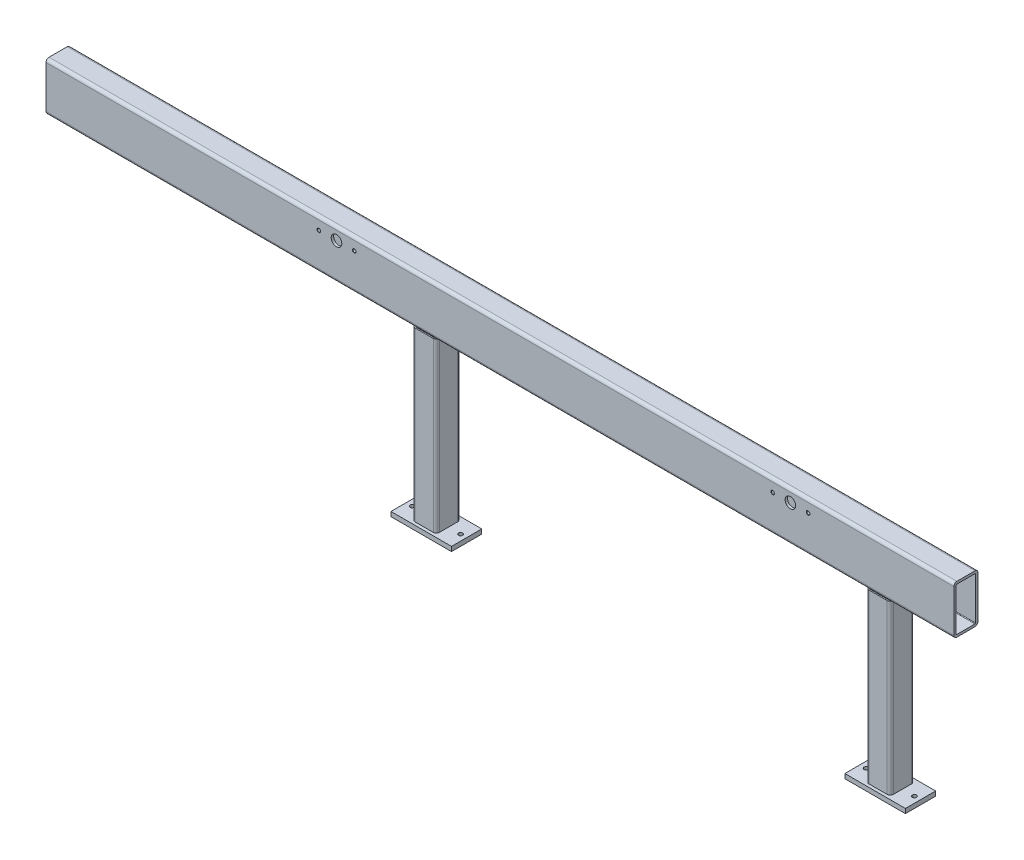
ISO-10303-21;
HEADER;
FILE_DESCRIPTION(('STEP AP214'),'2;1');
FILE_NAME('part.step','',(''),(''),'','','');
FILE_SCHEMA(('AUTOMOTIVE_DESIGN { 1 0 10303 214 1 1 1 1 }'));
ENDSEC;
DATA;
#1=APPLICATION_CONTEXT('core data for automotive mechanical design processes');
#2=APPLICATION_PROTOCOL_DEFINITION('international standard','automotive_design',2000,#1);
#3=PRODUCT_CONTEXT('',#1,'mechanical');
#4=PRODUCT('Part','Part','',(#3));
#5=PRODUCT_RELATED_PRODUCT_CATEGORY('part','',(#4));
#6=PRODUCT_DEFINITION_FORMATION('','',#4);
#7=PRODUCT_DEFINITION_CONTEXT('part definition',#1,'design');
#8=PRODUCT_DEFINITION('design','',#6,#7);
#9=PRODUCT_DEFINITION_SHAPE('','',#8);
#10=(LENGTH_UNIT() NAMED_UNIT(*) SI_UNIT(.MILLI.,.METRE.));
#11=(NAMED_UNIT(*) PLANE_ANGLE_UNIT() SI_UNIT($,.RADIAN.));
#12=(NAMED_UNIT(*) SI_UNIT($,.STERADIAN.) SOLID_ANGLE_UNIT());
#13=UNCERTAINTY_MEASURE_WITH_UNIT(LENGTH_MEASURE(1.E-05),#10,'distance_accuracy_value','');
#14=(GEOMETRIC_REPRESENTATION_CONTEXT(3) GLOBAL_UNCERTAINTY_ASSIGNED_CONTEXT((#13)) GLOBAL_UNIT_ASSIGNED_CONTEXT((#10,
#11,#12)) REPRESENTATION_CONTEXT('',''));
#15=CARTESIAN_POINT('',(0.,0.,0.));
#16=DIRECTION('',(0.,0.,1.));
#17=DIRECTION('',(1.,0.,0.));
#18=AXIS2_PLACEMENT_3D('',#15,#16,#17);
#19=CARTESIAN_POINT('',(-1650.,-715.,50.));
#20=DIRECTION('',(0.,0.,1.));
#21=DIRECTION('',(1.,0.,0.));
#22=AXIS2_PLACEMENT_3D('',#19,#20,#21);
#23=PLANE('',#22);
#24=DIRECTION('',(-1.,0.,0.));
#25=VECTOR('',#24,1.);
#26=CARTESIAN_POINT('',(-1650.,-730.,50.));
#27=LINE('',#26,#25);
#28=CARTESIAN_POINT('',(-1650.,-730.,50.));
#29=VERTEX_POINT('',#28);
#30=CARTESIAN_POINT('',(-1850.,-730.,50.));
#31=VERTEX_POINT('',#30);
#32=EDGE_CURVE('E166',#29,#31,#27,.T.);
#33=ORIENTED_EDGE('',*,*,#32,.F.);
#34=DIRECTION('',(0.,-1.,0.));
#35=VECTOR('',#34,1.);
#36=CARTESIAN_POINT('',(-1650.,-715.,50.));
#37=LINE('',#36,#35);
#38=CARTESIAN_POINT('',(-1650.,-715.,50.));
#39=VERTEX_POINT('',#38);
#40=EDGE_CURVE('E14',#39,#29,#37,.T.);
#41=ORIENTED_EDGE('',*,*,#40,.F.);
#42=DIRECTION('',(-1.,0.,0.));
#43=VECTOR('',#42,1.);
#44=CARTESIAN_POINT('',(-1650.,-715.,50.));
#45=LINE('',#44,#43);
#46=CARTESIAN_POINT('',(-1850.,-715.,50.));
#47=VERTEX_POINT('',#46);
#48=EDGE_CURVE('E159',#39,#47,#45,.T.);
#49=ORIENTED_EDGE('',*,*,#48,.T.);
#50=DIRECTION('',(0.,-1.,0.));
#51=VECTOR('',#50,1.);
#52=CARTESIAN_POINT('',(-1850.,-715.,50.));
#53=LINE('',#52,#51);
#54=EDGE_CURVE('E104',#47,#31,#53,.T.);
#55=ORIENTED_EDGE('',*,*,#54,.T.);
#56=EDGE_LOOP('',(#33,#41,#49,#55));
#57=FACE_BOUND('',#56,.T.);
#58=ADVANCED_FACE('F101',(#57),#23,.T.);
#59=CARTESIAN_POINT('',(-1650.,-715.,50.));
#60=DIRECTION('',(1.,0.,0.));
#61=DIRECTION('',(0.,0.,-1.));
#62=AXIS2_PLACEMENT_3D('',#59,#60,#61);
#63=PLANE('',#62);
#64=DIRECTION('',(0.,0.,1.));
#65=VECTOR('',#64,1.);
#66=CARTESIAN_POINT('',(-1650.,-730.,50.));
#67=LINE('',#66,#65);
#68=CARTESIAN_POINT('',(-1650.,-730.,-50.));
#69=VERTEX_POINT('',#68);
#70=EDGE_CURVE('E161',#69,#29,#67,.T.);
#71=ORIENTED_EDGE('',*,*,#70,.F.);
#72=DIRECTION('',(0.,-1.,0.));
#73=VECTOR('',#72,1.);
#74=CARTESIAN_POINT('',(-1650.,-715.,-50.));
#75=LINE('',#74,#73);
#76=CARTESIAN_POINT('',(-1650.,-715.,-50.));
#77=VERTEX_POINT('',#76);
#78=EDGE_CURVE('E110',#77,#69,#75,.T.);
#79=ORIENTED_EDGE('',*,*,#78,.F.);
#80=DIRECTION('',(0.,0.,1.));
#81=VECTOR('',#80,1.);
#82=CARTESIAN_POINT('',(-1650.,-715.,50.));
#83=LINE('',#82,#81);
#84=EDGE_CURVE('E156',#77,#39,#83,.T.);
#85=ORIENTED_EDGE('',*,*,#84,.T.);
#86=ORIENTED_EDGE('',*,*,#40,.T.);
#87=EDGE_LOOP('',(#71,#79,#85,#86));
#88=FACE_BOUND('',#87,.T.);
#89=ADVANCED_FACE('F177',(#88),#63,.T.);
#90=CARTESIAN_POINT('',(-1650.,-715.,-50.));
#91=DIRECTION('',(0.,0.,-1.));
#92=DIRECTION('',(-1.,0.,0.));
#93=AXIS2_PLACEMENT_3D('',#90,#91,#92);
#94=PLANE('',#93);
#95=DIRECTION('',(1.,0.,0.));
#96=VECTOR('',#95,1.);
#97=CARTESIAN_POINT('',(-1650.,-730.,-50.));
#98=LINE('',#97,#96);
#99=CARTESIAN_POINT('',(-1850.,-730.,-50.));
#100=VERTEX_POINT('',#99);
#101=EDGE_CURVE('E151',#100,#69,#98,.T.);
#102=ORIENTED_EDGE('',*,*,#101,.F.);
#103=DIRECTION('',(0.,-1.,0.));
#104=VECTOR('',#103,1.);
#105=CARTESIAN_POINT('',(-1850.,-715.,-50.));
#106=LINE('',#105,#104);
#107=CARTESIAN_POINT('',(-1850.,-715.,-50.));
#108=VERTEX_POINT('',#107);
#109=EDGE_CURVE('E146',#108,#100,#106,.T.);
#110=ORIENTED_EDGE('',*,*,#109,.F.);
#111=DIRECTION('',(1.,0.,0.));
#112=VECTOR('',#111,1.);
#113=CARTESIAN_POINT('',(-1650.,-715.,-50.));
#114=LINE('',#113,#112);
#115=EDGE_CURVE('E149',#108,#77,#114,.T.);
#116=ORIENTED_EDGE('',*,*,#115,.T.);
#117=ORIENTED_EDGE('',*,*,#78,.T.);
#118=EDGE_LOOP('',(#102,#110,#116,#117));
#119=FACE_BOUND('',#118,.T.);
#120=ADVANCED_FACE('F148',(#119),#94,.T.);
#121=CARTESIAN_POINT('',(-1850.,-715.,50.));
#122=DIRECTION('',(-1.,0.,0.));
#123=DIRECTION('',(0.,0.,1.));
#124=AXIS2_PLACEMENT_3D('',#121,#122,#123);
#125=PLANE('',#124);
#126=DIRECTION('',(0.,0.,-1.));
#127=VECTOR('',#126,1.);
#128=CARTESIAN_POINT('',(-1850.,-730.,50.));
#129=LINE('',#128,#127);
#130=EDGE_CURVE('E169',#31,#100,#129,.T.);
#131=ORIENTED_EDGE('',*,*,#130,.F.);
#132=ORIENTED_EDGE('',*,*,#54,.F.);
#133=DIRECTION('',(0.,0.,-1.));
#134=VECTOR('',#133,1.);
#135=CARTESIAN_POINT('',(-1850.,-715.,50.));
#136=LINE('',#135,#134);
#137=EDGE_CURVE('E155',#47,#108,#136,.T.);
#138=ORIENTED_EDGE('',*,*,#137,.T.);
#139=ORIENTED_EDGE('',*,*,#109,.T.);
#140=EDGE_LOOP('',(#131,#132,#138,#139));
#141=FACE_BOUND('',#140,.T.);
#142=ADVANCED_FACE('F158',(#141),#125,.T.);
#143=CARTESIAN_POINT('',(-1850.,-715.,50.));
#144=DIRECTION('',(0.,-1.,0.));
#145=DIRECTION('',(0.,0.,-1.));
#146=AXIS2_PLACEMENT_3D('',#143,#144,#145);
#147=PLANE('',#146);
#148=CARTESIAN_POINT('',(-1830.,-715.,0.));
#149=DIRECTION('',(0.,-1.,0.));
#150=DIRECTION('',(0.,0.,-1.));
#151=AXIS2_PLACEMENT_3D('',#148,#149,#150);
#152=CIRCLE('',#151,6.7499999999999);
#153=CARTESIAN_POINT('',(-1830.,-715.,-6.74999999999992));
#154=VERTEX_POINT('',#153);
#155=EDGE_CURVE('E213',#154,#154,#152,.T.);
#156=ORIENTED_EDGE('',*,*,#155,.T.);
#157=EDGE_LOOP('',(#156));
#158=FACE_BOUND('',#157,.T.);
#159=CARTESIAN_POINT('',(-1670.,-715.,0.));
#160=DIRECTION('',(0.,-1.,0.));
#161=DIRECTION('',(0.,0.,-1.));
#162=AXIS2_PLACEMENT_3D('',#159,#160,#161);
#163=CIRCLE('',#162,6.7499999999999);
#164=CARTESIAN_POINT('',(-1670.,-715.,-6.7499999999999));
#165=VERTEX_POINT('',#164);
#166=EDGE_CURVE('E170',#165,#165,#163,.T.);
#167=ORIENTED_EDGE('',*,*,#166,.T.);
#168=EDGE_LOOP('',(#167));
#169=FACE_BOUND('',#168,.T.);
#170=ORIENTED_EDGE('',*,*,#48,.F.);
#171=ORIENTED_EDGE('',*,*,#84,.F.);
#172=ORIENTED_EDGE('',*,*,#115,.F.);
#173=ORIENTED_EDGE('',*,*,#137,.F.);
#174=EDGE_LOOP('',(#170,#171,#172,#173));
#175=FACE_BOUND('',#174,.T.);
#176=ADVANCED_FACE('F154',(#158,#169,#175),#147,.F.);
#177=CARTESIAN_POINT('',(-1850.,-730.,50.));
#178=DIRECTION('',(0.,-1.,0.));
#179=DIRECTION('',(0.,0.,-1.));
#180=AXIS2_PLACEMENT_3D('',#177,#178,#179);
#181=PLANE('',#180);
#182=CARTESIAN_POINT('',(-1830.,-730.,0.));
#183=DIRECTION('',(0.,-1.,0.));
#184=DIRECTION('',(0.,0.,-1.));
#185=AXIS2_PLACEMENT_3D('',#182,#183,#184);
#186=CIRCLE('',#185,6.74999999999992);
#187=CARTESIAN_POINT('',(-1830.,-730.,-6.74999999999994));
#188=VERTEX_POINT('',#187);
#189=EDGE_CURVE('E211',#188,#188,#186,.T.);
#190=ORIENTED_EDGE('',*,*,#189,.F.);
#191=EDGE_LOOP('',(#190));
#192=FACE_BOUND('',#191,.T.);
#193=CARTESIAN_POINT('',(-1670.,-730.,0.));
#194=DIRECTION('',(0.,-1.,0.));
#195=DIRECTION('',(0.,0.,-1.));
#196=AXIS2_PLACEMENT_3D('',#193,#194,#195);
#197=CIRCLE('',#196,6.74999999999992);
#198=CARTESIAN_POINT('',(-1670.,-730.,-6.74999999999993));
#199=VERTEX_POINT('',#198);
#200=EDGE_CURVE('E214',#199,#199,#197,.T.);
#201=ORIENTED_EDGE('',*,*,#200,.F.);
#202=EDGE_LOOP('',(#201));
#203=FACE_BOUND('',#202,.T.);
#204=ORIENTED_EDGE('',*,*,#32,.T.);
#205=ORIENTED_EDGE('',*,*,#130,.T.);
#206=ORIENTED_EDGE('',*,*,#101,.T.);
#207=ORIENTED_EDGE('',*,*,#70,.T.);
#208=EDGE_LOOP('',(#204,#205,#206,#207));
#209=FACE_BOUND('',#208,.T.);
#210=ADVANCED_FACE('F176',(#192,#203,#209),#181,.T.);
#211=CARTESIAN_POINT('',(-1670.,-730.,0.));
#212=DIRECTION('',(0.,-1.,0.));
#213=DIRECTION('',(0.,0.,-1.));
#214=AXIS2_PLACEMENT_3D('',#211,#212,#213);
#215=CYLINDRICAL_SURFACE('',#214,6.7499999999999);
#216=ORIENTED_EDGE('',*,*,#200,.T.);
#217=EDGE_LOOP('',(#216));
#218=FACE_BOUND('',#217,.T.);
#219=ORIENTED_EDGE('',*,*,#166,.F.);
#220=EDGE_LOOP('',(#219));
#221=FACE_BOUND('',#220,.T.);
#222=ADVANCED_FACE('F195',(#218,#221),#215,.F.);
#223=CARTESIAN_POINT('',(-1830.,-730.,0.));
#224=DIRECTION('',(0.,-1.,0.));
#225=DIRECTION('',(0.,0.,-1.));
#226=AXIS2_PLACEMENT_3D('',#223,#224,#225);
#227=CYLINDRICAL_SURFACE('',#226,6.7499999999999);
#228=ORIENTED_EDGE('',*,*,#189,.T.);
#229=EDGE_LOOP('',(#228));
#230=FACE_BOUND('',#229,.T.);
#231=ORIENTED_EDGE('',*,*,#155,.F.);
#232=EDGE_LOOP('',(#231));
#233=FACE_BOUND('',#232,.T.);
#234=ADVANCED_FACE('F202',(#230,#233),#227,.F.);
#235=CLOSED_SHELL('',(#58,#89,#120,#142,#176,#210,#222,#234));
#236=MANIFOLD_SOLID_BREP('B2',#235);
#237=CARTESIAN_POINT('',(-1780.,0.,30.));
#238=DIRECTION('',(0.,-1.,0.));
#239=DIRECTION('',(0.,0.,-1.));
#240=AXIS2_PLACEMENT_3D('',#237,#238,#239);
#241=CYLINDRICAL_SURFACE('',#240,6.00000000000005);
#242=CARTESIAN_POINT('',(-1780.,-160.,30.));
#243=DIRECTION('',(0.,-1.,0.));
#244=DIRECTION('',(0.,0.,-1.));
#245=AXIS2_PLACEMENT_3D('',#242,#243,#244);
#246=CIRCLE('',#245,6.00000000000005);
#247=CARTESIAN_POINT('',(-1780.,-160.,36.));
#248=VERTEX_POINT('',#247);
#249=CARTESIAN_POINT('',(-1786.,-160.,30.));
#250=VERTEX_POINT('',#249);
#251=EDGE_CURVE('E395',#248,#250,#246,.T.);
#252=ORIENTED_EDGE('',*,*,#251,.F.);
#253=DIRECTION('',(0.,-1.,0.));
#254=VECTOR('',#253,1.);
#255=CARTESIAN_POINT('',(-1780.,0.,36.));
#256=LINE('',#255,#254);
#257=CARTESIAN_POINT('',(-1780.,-715.,36.));
#258=VERTEX_POINT('',#257);
#259=EDGE_CURVE('E458',#248,#258,#256,.T.);
#260=ORIENTED_EDGE('',*,*,#259,.T.);
#261=CARTESIAN_POINT('',(-1780.,-715.,30.));
#262=DIRECTION('',(0.,1.,0.));
#263=DIRECTION('',(0.,0.,1.));
#264=AXIS2_PLACEMENT_3D('',#261,#262,#263);
#265=CIRCLE('',#264,6.00000000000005);
#266=CARTESIAN_POINT('',(-1786.,-715.,30.));
#267=VERTEX_POINT('',#266);
#268=EDGE_CURVE('E396',#267,#258,#265,.T.);
#269=ORIENTED_EDGE('',*,*,#268,.F.);
#270=DIRECTION('',(0.,-1.,0.));
#271=VECTOR('',#270,1.);
#272=CARTESIAN_POINT('',(-1786.,0.,30.));
#273=LINE('',#272,#271);
#274=EDGE_CURVE('E456',#250,#267,#273,.T.);
#275=ORIENTED_EDGE('',*,*,#274,.F.);
#276=EDGE_LOOP('',(#252,#260,#269,#275));
#277=FACE_BOUND('',#276,.T.);
#278=ADVANCED_FACE('F278',(#277),#241,.F.);
#279=CARTESIAN_POINT('',(-1786.,0.,30.));
#280=DIRECTION('',(1.,0.,0.));
#281=DIRECTION('',(0.,0.,-1.));
#282=AXIS2_PLACEMENT_3D('',#279,#280,#281);
#283=PLANE('',#282);
#284=DIRECTION('',(0.,0.,-1.));
#285=VECTOR('',#284,1.);
#286=CARTESIAN_POINT('',(-1786.,-160.,29.9999999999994));
#287=LINE('',#286,#285);
#288=CARTESIAN_POINT('',(-1786.,-160.,-30.));
#289=VERTEX_POINT('',#288);
#290=EDGE_CURVE('E477',#250,#289,#287,.T.);
#291=ORIENTED_EDGE('',*,*,#290,.F.);
#292=ORIENTED_EDGE('',*,*,#274,.T.);
#293=DIRECTION('',(0.,0.,1.));
#294=VECTOR('',#293,1.);
#295=CARTESIAN_POINT('',(-1786.,-715.,30.));
#296=LINE('',#295,#294);
#297=CARTESIAN_POINT('',(-1786.,-715.,-30.));
#298=VERTEX_POINT('',#297);
#299=EDGE_CURVE('E392',#298,#267,#296,.T.);
#300=ORIENTED_EDGE('',*,*,#299,.F.);
#301=DIRECTION('',(0.,-1.,0.));
#302=VECTOR('',#301,1.);
#303=CARTESIAN_POINT('',(-1786.,0.,-30.));
#304=LINE('',#303,#302);
#305=EDGE_CURVE('E454',#289,#298,#304,.T.);
#306=ORIENTED_EDGE('',*,*,#305,.F.);
#307=EDGE_LOOP('',(#291,#292,#300,#306));
#308=FACE_BOUND('',#307,.T.);
#309=ADVANCED_FACE('F505',(#308),#283,.T.);
#310=CARTESIAN_POINT('',(-1780.,0.,-30.));
#311=DIRECTION('',(0.,-1.,0.));
#312=DIRECTION('',(0.,0.,-1.));
#313=AXIS2_PLACEMENT_3D('',#310,#311,#312);
#314=CYLINDRICAL_SURFACE('',#313,6.00000000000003);
#315=CARTESIAN_POINT('',(-1780.,-160.,-30.));
#316=DIRECTION('',(0.,-1.,0.));
#317=DIRECTION('',(0.,0.,-1.));
#318=AXIS2_PLACEMENT_3D('',#315,#316,#317);
#319=CIRCLE('',#318,6.00000000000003);
#320=CARTESIAN_POINT('',(-1780.,-160.,-36.));
#321=VERTEX_POINT('',#320);
#322=EDGE_CURVE('E480',#289,#321,#319,.T.);
#323=ORIENTED_EDGE('',*,*,#322,.F.);
#324=ORIENTED_EDGE('',*,*,#305,.T.);
#325=CARTESIAN_POINT('',(-1780.,-715.,-30.));
#326=DIRECTION('',(0.,1.,0.));
#327=DIRECTION('',(0.,0.,1.));
#328=AXIS2_PLACEMENT_3D('',#325,#326,#327);
#329=CIRCLE('',#328,6.00000000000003);
#330=CARTESIAN_POINT('',(-1780.,-715.,-36.));
#331=VERTEX_POINT('',#330);
#332=EDGE_CURVE('E389',#331,#298,#329,.T.);
#333=ORIENTED_EDGE('',*,*,#332,.F.);
#334=DIRECTION('',(0.,-1.,0.));
#335=VECTOR('',#334,1.);
#336=CARTESIAN_POINT('',(-1780.,0.,-36.));
#337=LINE('',#336,#335);
#338=EDGE_CURVE('E452',#321,#331,#337,.T.);
#339=ORIENTED_EDGE('',*,*,#338,.F.);
#340=EDGE_LOOP('',(#323,#324,#333,#339));
#341=FACE_BOUND('',#340,.T.);
#342=ADVANCED_FACE('F528',(#341),#314,.F.);
#343=CARTESIAN_POINT('',(-1720.,0.,-36.));
#344=DIRECTION('',(0.,0.,1.));
#345=DIRECTION('',(1.,0.,0.));
#346=AXIS2_PLACEMENT_3D('',#343,#344,#345);
#347=PLANE('',#346);
#348=DIRECTION('',(1.,0.,0.));
#349=VECTOR('',#348,1.);
#350=CARTESIAN_POINT('',(-1720.,-160.,-36.));
#351=LINE('',#350,#349);
#352=CARTESIAN_POINT('',(-1720.,-160.,-36.));
#353=VERTEX_POINT('',#352);
#354=EDGE_CURVE('E483',#321,#353,#351,.T.);
#355=ORIENTED_EDGE('',*,*,#354,.F.);
#356=ORIENTED_EDGE('',*,*,#338,.T.);
#357=DIRECTION('',(-1.,0.,0.));
#358=VECTOR('',#357,1.);
#359=CARTESIAN_POINT('',(-1720.,-715.,-36.));
#360=LINE('',#359,#358);
#361=CARTESIAN_POINT('',(-1720.,-715.,-36.));
#362=VERTEX_POINT('',#361);
#363=EDGE_CURVE('E384',#362,#331,#360,.T.);
#364=ORIENTED_EDGE('',*,*,#363,.F.);
#365=DIRECTION('',(0.,-1.,0.));
#366=VECTOR('',#365,1.);
#367=CARTESIAN_POINT('',(-1720.,0.,-36.));
#368=LINE('',#367,#366);
#369=EDGE_CURVE('E450',#353,#362,#368,.T.);
#370=ORIENTED_EDGE('',*,*,#369,.F.);
#371=EDGE_LOOP('',(#355,#356,#364,#370));
#372=FACE_BOUND('',#371,.T.);
#373=ADVANCED_FACE('F524',(#372),#347,.T.);
#374=CARTESIAN_POINT('',(-1720.,0.,-30.));
#375=DIRECTION('',(0.,-1.,0.));
#376=DIRECTION('',(0.,0.,-1.));
#377=AXIS2_PLACEMENT_3D('',#374,#375,#376);
#378=CYLINDRICAL_SURFACE('',#377,6.00000000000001);
#379=CARTESIAN_POINT('',(-1720.,-160.,-30.));
#380=DIRECTION('',(0.,-1.,0.));
#381=DIRECTION('',(0.,0.,-1.));
#382=AXIS2_PLACEMENT_3D('',#379,#380,#381);
#383=CIRCLE('',#382,6.00000000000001);
#384=CARTESIAN_POINT('',(-1714.,-160.,-30.));
#385=VERTEX_POINT('',#384);
#386=EDGE_CURVE('E486',#353,#385,#383,.T.);
#387=ORIENTED_EDGE('',*,*,#386,.F.);
#388=ORIENTED_EDGE('',*,*,#369,.T.);
#389=CARTESIAN_POINT('',(-1720.,-715.,-30.));
#390=DIRECTION('',(0.,1.,0.));
#391=DIRECTION('',(0.,0.,1.));
#392=AXIS2_PLACEMENT_3D('',#389,#390,#391);
#393=CIRCLE('',#392,6.00000000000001);
#394=CARTESIAN_POINT('',(-1714.,-715.,-30.));
#395=VERTEX_POINT('',#394);
#396=EDGE_CURVE('E382',#395,#362,#393,.T.);
#397=ORIENTED_EDGE('',*,*,#396,.F.);
#398=DIRECTION('',(0.,-1.,0.));
#399=VECTOR('',#398,1.);
#400=CARTESIAN_POINT('',(-1714.,0.,-30.));
#401=LINE('',#400,#399);
#402=EDGE_CURVE('E366',#385,#395,#401,.T.);
#403=ORIENTED_EDGE('',*,*,#402,.F.);
#404=EDGE_LOOP('',(#387,#388,#397,#403));
#405=FACE_BOUND('',#404,.T.);
#406=ADVANCED_FACE('F521',(#405),#378,.F.);
#407=CARTESIAN_POINT('',(-1714.,0.,30.));
#408=DIRECTION('',(-1.,0.,0.));
#409=DIRECTION('',(0.,0.,1.));
#410=AXIS2_PLACEMENT_3D('',#407,#408,#409);
#411=PLANE('',#410);
#412=DIRECTION('',(0.,0.,1.));
#413=VECTOR('',#412,1.);
#414=CARTESIAN_POINT('',(-1714.,-160.,29.9999999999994));
#415=LINE('',#414,#413);
#416=CARTESIAN_POINT('',(-1714.,-160.,30.));
#417=VERTEX_POINT('',#416);
#418=EDGE_CURVE('E488',#385,#417,#415,.T.);
#419=ORIENTED_EDGE('',*,*,#418,.F.);
#420=ORIENTED_EDGE('',*,*,#402,.T.);
#421=DIRECTION('',(0.,0.,-1.));
#422=VECTOR('',#421,1.);
#423=CARTESIAN_POINT('',(-1714.,-715.,30.));
#424=LINE('',#423,#422);
#425=CARTESIAN_POINT('',(-1714.,-715.,30.));
#426=VERTEX_POINT('',#425);
#427=EDGE_CURVE('E375',#426,#395,#424,.T.);
#428=ORIENTED_EDGE('',*,*,#427,.F.);
#429=DIRECTION('',(0.,-1.,0.));
#430=VECTOR('',#429,1.);
#431=CARTESIAN_POINT('',(-1714.,0.,30.));
#432=LINE('',#431,#430);
#433=EDGE_CURVE('E358',#417,#426,#432,.T.);
#434=ORIENTED_EDGE('',*,*,#433,.F.);
#435=EDGE_LOOP('',(#419,#420,#428,#434));
#436=FACE_BOUND('',#435,.T.);
#437=ADVANCED_FACE('F380',(#436),#411,.T.);
#438=CARTESIAN_POINT('',(-1720.,0.,30.));
#439=DIRECTION('',(0.,-1.,0.));
#440=DIRECTION('',(0.,0.,-1.));
#441=AXIS2_PLACEMENT_3D('',#438,#439,#440);
#442=CYLINDRICAL_SURFACE('',#441,6.);
#443=CARTESIAN_POINT('',(-1720.,-160.,30.));
#444=DIRECTION('',(0.,-1.,0.));
#445=DIRECTION('',(0.,0.,-1.));
#446=AXIS2_PLACEMENT_3D('',#443,#444,#445);
#447=CIRCLE('',#446,6.);
#448=CARTESIAN_POINT('',(-1720.,-160.,36.));
#449=VERTEX_POINT('',#448);
#450=EDGE_CURVE('E282',#417,#449,#447,.T.);
#451=ORIENTED_EDGE('',*,*,#450,.F.);
#452=ORIENTED_EDGE('',*,*,#433,.T.);
#453=CARTESIAN_POINT('',(-1720.,-715.,30.));
#454=DIRECTION('',(0.,1.,0.));
#455=DIRECTION('',(0.,0.,1.));
#456=AXIS2_PLACEMENT_3D('',#453,#454,#455);
#457=CIRCLE('',#456,6.);
#458=CARTESIAN_POINT('',(-1720.,-715.,36.));
#459=VERTEX_POINT('',#458);
#460=EDGE_CURVE('E362',#459,#426,#457,.T.);
#461=ORIENTED_EDGE('',*,*,#460,.F.);
#462=DIRECTION('',(0.,-1.,0.));
#463=VECTOR('',#462,1.);
#464=CARTESIAN_POINT('',(-1720.,0.,36.));
#465=LINE('',#464,#463);
#466=EDGE_CURVE('E398',#449,#459,#465,.T.);
#467=ORIENTED_EDGE('',*,*,#466,.F.);
#468=EDGE_LOOP('',(#451,#452,#461,#467));
#469=FACE_BOUND('',#468,.T.);
#470=ADVANCED_FACE('F360',(#469),#442,.F.);
#471=CARTESIAN_POINT('',(-1780.,0.,30.));
#472=DIRECTION('',(0.,-1.,0.));
#473=DIRECTION('',(0.,0.,-1.));
#474=AXIS2_PLACEMENT_3D('',#471,#472,#473);
#475=CYLINDRICAL_SURFACE('',#474,10.0000000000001);
#476=DIRECTION('',(0.,-1.,0.));
#477=VECTOR('',#476,1.);
#478=CARTESIAN_POINT('',(-1780.,0.,40.));
#479=LINE('',#478,#477);
#480=CARTESIAN_POINT('',(-1780.,-160.,40.));
#481=VERTEX_POINT('',#480);
#482=CARTESIAN_POINT('',(-1780.,-715.,40.));
#483=VERTEX_POINT('',#482);
#484=EDGE_CURVE('E432',#481,#483,#479,.T.);
#485=ORIENTED_EDGE('',*,*,#484,.F.);
#486=CARTESIAN_POINT('',(-1780.,-160.,30.));
#487=DIRECTION('',(0.,-1.,0.));
#488=DIRECTION('',(0.,0.,-1.));
#489=AXIS2_PLACEMENT_3D('',#486,#487,#488);
#490=CIRCLE('',#489,10.0000000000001);
#491=CARTESIAN_POINT('',(-1790.,-160.,30.));
#492=VERTEX_POINT('',#491);
#493=EDGE_CURVE('E296',#481,#492,#490,.T.);
#494=ORIENTED_EDGE('',*,*,#493,.T.);
#495=DIRECTION('',(0.,-1.,0.));
#496=VECTOR('',#495,1.);
#497=CARTESIAN_POINT('',(-1790.,0.,30.));
#498=LINE('',#497,#496);
#499=CARTESIAN_POINT('',(-1790.,-715.,30.));
#500=VERTEX_POINT('',#499);
#501=EDGE_CURVE('E437',#492,#500,#498,.T.);
#502=ORIENTED_EDGE('',*,*,#501,.T.);
#503=CARTESIAN_POINT('',(-1780.,-715.,30.));
#504=DIRECTION('',(0.,1.,0.));
#505=DIRECTION('',(0.,0.,1.));
#506=AXIS2_PLACEMENT_3D('',#503,#504,#505);
#507=CIRCLE('',#506,10.0000000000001);
#508=EDGE_CURVE('E433',#500,#483,#507,.T.);
#509=ORIENTED_EDGE('',*,*,#508,.T.);
#510=EDGE_LOOP('',(#485,#494,#502,#509));
#511=FACE_BOUND('',#510,.T.);
#512=ADVANCED_FACE('F584',(#511),#475,.T.);
#513=CARTESIAN_POINT('',(-1720.,0.,40.));
#514=DIRECTION('',(0.,0.,-1.));
#515=DIRECTION('',(-1.,0.,0.));
#516=AXIS2_PLACEMENT_3D('',#513,#514,#515);
#517=PLANE('',#516);
#518=DIRECTION('',(0.,-1.,0.));
#519=VECTOR('',#518,1.);
#520=CARTESIAN_POINT('',(-1720.,0.,40.));
#521=LINE('',#520,#519);
#522=CARTESIAN_POINT('',(-1720.,-160.,40.));
#523=VERTEX_POINT('',#522);
#524=CARTESIAN_POINT('',(-1720.,-715.,40.));
#525=VERTEX_POINT('',#524);
#526=EDGE_CURVE('E427',#523,#525,#521,.T.);
#527=ORIENTED_EDGE('',*,*,#526,.F.);
#528=DIRECTION('',(-1.,0.,0.));
#529=VECTOR('',#528,1.);
#530=CARTESIAN_POINT('',(-1720.,-160.,40.));
#531=LINE('',#530,#529);
#532=EDGE_CURVE('E436',#523,#481,#531,.T.);
#533=ORIENTED_EDGE('',*,*,#532,.T.);
#534=ORIENTED_EDGE('',*,*,#484,.T.);
#535=DIRECTION('',(1.,0.,0.));
#536=VECTOR('',#535,1.);
#537=CARTESIAN_POINT('',(-1720.,-715.,40.));
#538=LINE('',#537,#536);
#539=EDGE_CURVE('E428',#483,#525,#538,.T.);
#540=ORIENTED_EDGE('',*,*,#539,.T.);
#541=EDGE_LOOP('',(#527,#533,#534,#540));
#542=FACE_BOUND('',#541,.T.);
#543=ADVANCED_FACE('F594',(#542),#517,.F.);
#544=CARTESIAN_POINT('',(-1720.,0.,30.));
#545=DIRECTION('',(0.,-1.,0.));
#546=DIRECTION('',(0.,0.,-1.));
#547=AXIS2_PLACEMENT_3D('',#544,#545,#546);
#548=CYLINDRICAL_SURFACE('',#547,10.);
#549=DIRECTION('',(0.,-1.,0.));
#550=VECTOR('',#549,1.);
#551=CARTESIAN_POINT('',(-1710.,0.,30.));
#552=LINE('',#551,#550);
#553=CARTESIAN_POINT('',(-1710.,-160.,30.));
#554=VERTEX_POINT('',#553);
#555=CARTESIAN_POINT('',(-1710.,-715.,30.));
#556=VERTEX_POINT('',#555);
#557=EDGE_CURVE('E422',#554,#556,#552,.T.);
#558=ORIENTED_EDGE('',*,*,#557,.F.);
#559=CARTESIAN_POINT('',(-1720.,-160.,30.));
#560=DIRECTION('',(0.,-1.,0.));
#561=DIRECTION('',(0.,0.,-1.));
#562=AXIS2_PLACEMENT_3D('',#559,#560,#561);
#563=CIRCLE('',#562,10.);
#564=EDGE_CURVE('E431',#554,#523,#563,.T.);
#565=ORIENTED_EDGE('',*,*,#564,.T.);
#566=ORIENTED_EDGE('',*,*,#526,.T.);
#567=CARTESIAN_POINT('',(-1720.,-715.,30.));
#568=DIRECTION('',(0.,1.,0.));
#569=DIRECTION('',(0.,0.,1.));
#570=AXIS2_PLACEMENT_3D('',#567,#568,#569);
#571=CIRCLE('',#570,10.);
#572=EDGE_CURVE('E423',#525,#556,#571,.T.);
#573=ORIENTED_EDGE('',*,*,#572,.T.);
#574=EDGE_LOOP('',(#558,#565,#566,#573));
#575=FACE_BOUND('',#574,.T.);
#576=ADVANCED_FACE('F605',(#575),#548,.T.);
#577=CARTESIAN_POINT('',(-1710.,0.,30.));
#578=DIRECTION('',(-1.,0.,0.));
#579=DIRECTION('',(0.,0.,1.));
#580=AXIS2_PLACEMENT_3D('',#577,#578,#579);
#581=PLANE('',#580);
#582=DIRECTION('',(0.,-1.,0.));
#583=VECTOR('',#582,1.);
#584=CARTESIAN_POINT('',(-1710.,0.,-30.));
#585=LINE('',#584,#583);
#586=CARTESIAN_POINT('',(-1710.,-160.,-30.));
#587=VERTEX_POINT('',#586);
#588=CARTESIAN_POINT('',(-1710.,-715.,-30.));
#589=VERTEX_POINT('',#588);
#590=EDGE_CURVE('E417',#587,#589,#585,.T.);
#591=ORIENTED_EDGE('',*,*,#590,.F.);
#592=DIRECTION('',(0.,0.,1.));
#593=VECTOR('',#592,1.);
#594=CARTESIAN_POINT('',(-1710.,-160.,29.9999999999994));
#595=LINE('',#594,#593);
#596=EDGE_CURVE('E426',#587,#554,#595,.T.);
#597=ORIENTED_EDGE('',*,*,#596,.T.);
#598=ORIENTED_EDGE('',*,*,#557,.T.);
#599=DIRECTION('',(0.,0.,-1.));
#600=VECTOR('',#599,1.);
#601=CARTESIAN_POINT('',(-1710.,-715.,30.));
#602=LINE('',#601,#600);
#603=EDGE_CURVE('E418',#556,#589,#602,.T.);
#604=ORIENTED_EDGE('',*,*,#603,.T.);
#605=EDGE_LOOP('',(#591,#597,#598,#604));
#606=FACE_BOUND('',#605,.T.);
#607=ADVANCED_FACE('F616',(#606),#581,.F.);
#608=CARTESIAN_POINT('',(-1720.,0.,-30.));
#609=DIRECTION('',(0.,-1.,0.));
#610=DIRECTION('',(0.,0.,-1.));
#611=AXIS2_PLACEMENT_3D('',#608,#609,#610);
#612=CYLINDRICAL_SURFACE('',#611,10.);
#613=DIRECTION('',(0.,-1.,0.));
#614=VECTOR('',#613,1.);
#615=CARTESIAN_POINT('',(-1720.,0.,-40.));
#616=LINE('',#615,#614);
#617=CARTESIAN_POINT('',(-1720.,-160.,-40.));
#618=VERTEX_POINT('',#617);
#619=CARTESIAN_POINT('',(-1720.,-715.,-40.));
#620=VERTEX_POINT('',#619);
#621=EDGE_CURVE('E412',#618,#620,#616,.T.);
#622=ORIENTED_EDGE('',*,*,#621,.F.);
#623=CARTESIAN_POINT('',(-1720.,-160.,-30.));
#624=DIRECTION('',(0.,-1.,0.));
#625=DIRECTION('',(0.,0.,-1.));
#626=AXIS2_PLACEMENT_3D('',#623,#624,#625);
#627=CIRCLE('',#626,10.);
#628=EDGE_CURVE('E421',#618,#587,#627,.T.);
#629=ORIENTED_EDGE('',*,*,#628,.T.);
#630=ORIENTED_EDGE('',*,*,#590,.T.);
#631=CARTESIAN_POINT('',(-1720.,-715.,-30.));
#632=DIRECTION('',(0.,1.,0.));
#633=DIRECTION('',(0.,0.,1.));
#634=AXIS2_PLACEMENT_3D('',#631,#632,#633);
#635=CIRCLE('',#634,10.);
#636=EDGE_CURVE('E413',#589,#620,#635,.T.);
#637=ORIENTED_EDGE('',*,*,#636,.T.);
#638=EDGE_LOOP('',(#622,#629,#630,#637));
#639=FACE_BOUND('',#638,.T.);
#640=ADVANCED_FACE('F627',(#639),#612,.T.);
#641=CARTESIAN_POINT('',(-1720.,0.,-40.));
#642=DIRECTION('',(0.,0.,1.));
#643=DIRECTION('',(1.,0.,0.));
#644=AXIS2_PLACEMENT_3D('',#641,#642,#643);
#645=PLANE('',#644);
#646=DIRECTION('',(0.,-1.,0.));
#647=VECTOR('',#646,1.);
#648=CARTESIAN_POINT('',(-1780.,0.,-40.));
#649=LINE('',#648,#647);
#650=CARTESIAN_POINT('',(-1780.,-160.,-40.));
#651=VERTEX_POINT('',#650);
#652=CARTESIAN_POINT('',(-1780.,-715.,-40.));
#653=VERTEX_POINT('',#652);
#654=EDGE_CURVE('E407',#651,#653,#649,.T.);
#655=ORIENTED_EDGE('',*,*,#654,.F.);
#656=DIRECTION('',(1.,0.,0.));
#657=VECTOR('',#656,1.);
#658=CARTESIAN_POINT('',(-1720.,-160.,-40.));
#659=LINE('',#658,#657);
#660=EDGE_CURVE('E416',#651,#618,#659,.T.);
#661=ORIENTED_EDGE('',*,*,#660,.T.);
#662=ORIENTED_EDGE('',*,*,#621,.T.);
#663=DIRECTION('',(-1.,0.,0.));
#664=VECTOR('',#663,1.);
#665=CARTESIAN_POINT('',(-1720.,-715.,-40.));
#666=LINE('',#665,#664);
#667=EDGE_CURVE('E408',#620,#653,#666,.T.);
#668=ORIENTED_EDGE('',*,*,#667,.T.);
#669=EDGE_LOOP('',(#655,#661,#662,#668));
#670=FACE_BOUND('',#669,.T.);
#671=ADVANCED_FACE('F638',(#670),#645,.F.);
#672=CARTESIAN_POINT('',(-1780.,0.,-30.));
#673=DIRECTION('',(0.,-1.,0.));
#674=DIRECTION('',(0.,0.,-1.));
#675=AXIS2_PLACEMENT_3D('',#672,#673,#674);
#676=CYLINDRICAL_SURFACE('',#675,10.);
#677=DIRECTION('',(0.,-1.,0.));
#678=VECTOR('',#677,1.);
#679=CARTESIAN_POINT('',(-1790.,0.,-30.));
#680=LINE('',#679,#678);
#681=CARTESIAN_POINT('',(-1790.,-160.,-30.));
#682=VERTEX_POINT('',#681);
#683=CARTESIAN_POINT('',(-1790.,-715.,-30.));
#684=VERTEX_POINT('',#683);
#685=EDGE_CURVE('E402',#682,#684,#680,.T.);
#686=ORIENTED_EDGE('',*,*,#685,.F.);
#687=CARTESIAN_POINT('',(-1780.,-160.,-30.));
#688=DIRECTION('',(0.,-1.,0.));
#689=DIRECTION('',(0.,0.,-1.));
#690=AXIS2_PLACEMENT_3D('',#687,#688,#689);
#691=CIRCLE('',#690,10.);
#692=EDGE_CURVE('E411',#682,#651,#691,.T.);
#693=ORIENTED_EDGE('',*,*,#692,.T.);
#694=ORIENTED_EDGE('',*,*,#654,.T.);
#695=CARTESIAN_POINT('',(-1780.,-715.,-30.));
#696=DIRECTION('',(0.,1.,0.));
#697=DIRECTION('',(0.,0.,1.));
#698=AXIS2_PLACEMENT_3D('',#695,#696,#697);
#699=CIRCLE('',#698,10.);
#700=EDGE_CURVE('E403',#653,#684,#699,.T.);
#701=ORIENTED_EDGE('',*,*,#700,.T.);
#702=EDGE_LOOP('',(#686,#693,#694,#701));
#703=FACE_BOUND('',#702,.T.);
#704=ADVANCED_FACE('F649',(#703),#676,.T.);
#705=CARTESIAN_POINT('',(-1790.,0.,30.));
#706=DIRECTION('',(1.,0.,0.));
#707=DIRECTION('',(0.,0.,-1.));
#708=AXIS2_PLACEMENT_3D('',#705,#706,#707);
#709=PLANE('',#708);
#710=ORIENTED_EDGE('',*,*,#501,.F.);
#711=DIRECTION('',(0.,0.,-1.));
#712=VECTOR('',#711,1.);
#713=CARTESIAN_POINT('',(-1790.,-160.,29.9999999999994));
#714=LINE('',#713,#712);
#715=EDGE_CURVE('E406',#492,#682,#714,.T.);
#716=ORIENTED_EDGE('',*,*,#715,.T.);
#717=ORIENTED_EDGE('',*,*,#685,.T.);
#718=DIRECTION('',(0.,0.,1.));
#719=VECTOR('',#718,1.);
#720=CARTESIAN_POINT('',(-1790.,-715.,30.));
#721=LINE('',#720,#719);
#722=EDGE_CURVE('E399',#684,#500,#721,.T.);
#723=ORIENTED_EDGE('',*,*,#722,.T.);
#724=EDGE_LOOP('',(#710,#716,#717,#723));
#725=FACE_BOUND('',#724,.T.);
#726=ADVANCED_FACE('F660',(#725),#709,.F.);
#727=CARTESIAN_POINT('',(-1720.,0.,36.));
#728=DIRECTION('',(0.,0.,-1.));
#729=DIRECTION('',(-1.,0.,0.));
#730=AXIS2_PLACEMENT_3D('',#727,#728,#729);
#731=PLANE('',#730);
#732=DIRECTION('',(-1.,0.,0.));
#733=VECTOR('',#732,1.);
#734=CARTESIAN_POINT('',(-1720.,-160.,36.));
#735=LINE('',#734,#733);
#736=EDGE_CURVE('E99',#449,#248,#735,.T.);
#737=ORIENTED_EDGE('',*,*,#736,.F.);
#738=ORIENTED_EDGE('',*,*,#466,.T.);
#739=DIRECTION('',(1.,0.,0.));
#740=VECTOR('',#739,1.);
#741=CARTESIAN_POINT('',(-1720.,-715.,36.));
#742=LINE('',#741,#740);
#743=EDGE_CURVE('E378',#258,#459,#742,.T.);
#744=ORIENTED_EDGE('',*,*,#743,.F.);
#745=ORIENTED_EDGE('',*,*,#259,.F.);
#746=EDGE_LOOP('',(#737,#738,#744,#745));
#747=FACE_BOUND('',#746,.T.);
#748=ADVANCED_FACE('F495',(#747),#731,.T.);
#749=CARTESIAN_POINT('',(-1750.,-715.,0.));
#750=DIRECTION('',(0.,1.,0.));
#751=DIRECTION('',(0.,0.,1.));
#752=AXIS2_PLACEMENT_3D('',#749,#750,#751);
#753=PLANE('',#752);
#754=ORIENTED_EDGE('',*,*,#268,.T.);
#755=ORIENTED_EDGE('',*,*,#743,.T.);
#756=ORIENTED_EDGE('',*,*,#460,.T.);
#757=ORIENTED_EDGE('',*,*,#427,.T.);
#758=ORIENTED_EDGE('',*,*,#396,.T.);
#759=ORIENTED_EDGE('',*,*,#363,.T.);
#760=ORIENTED_EDGE('',*,*,#332,.T.);
#761=ORIENTED_EDGE('',*,*,#299,.T.);
#762=EDGE_LOOP('',(#754,#755,#756,#757,#758,#759,#760,#761));
#763=FACE_BOUND('',#762,.T.);
#764=ORIENTED_EDGE('',*,*,#722,.F.);
#765=ORIENTED_EDGE('',*,*,#700,.F.);
#766=ORIENTED_EDGE('',*,*,#667,.F.);
#767=ORIENTED_EDGE('',*,*,#636,.F.);
#768=ORIENTED_EDGE('',*,*,#603,.F.);
#769=ORIENTED_EDGE('',*,*,#572,.F.);
#770=ORIENTED_EDGE('',*,*,#539,.F.);
#771=ORIENTED_EDGE('',*,*,#508,.F.);
#772=EDGE_LOOP('',(#764,#765,#766,#767,#768,#769,#770,#771));
#773=FACE_BOUND('',#772,.T.);
#774=ADVANCED_FACE('F372',(#763,#773),#753,.F.);
#775=CARTESIAN_POINT('',(-3000.,-160.,-5.55111512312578E-13));
#776=DIRECTION('',(0.,-1.,0.));
#777=DIRECTION('',(0.,0.,-1.));
#778=AXIS2_PLACEMENT_3D('',#775,#776,#777);
#779=PLANE('',#778);
#780=ORIENTED_EDGE('',*,*,#251,.T.);
#781=ORIENTED_EDGE('',*,*,#290,.T.);
#782=ORIENTED_EDGE('',*,*,#322,.T.);
#783=ORIENTED_EDGE('',*,*,#354,.T.);
#784=ORIENTED_EDGE('',*,*,#386,.T.);
#785=ORIENTED_EDGE('',*,*,#418,.T.);
#786=ORIENTED_EDGE('',*,*,#450,.T.);
#787=ORIENTED_EDGE('',*,*,#736,.T.);
#788=EDGE_LOOP('',(#780,#781,#782,#783,#784,#785,#786,#787));
#789=FACE_BOUND('',#788,.T.);
#790=ORIENTED_EDGE('',*,*,#532,.F.);
#791=ORIENTED_EDGE('',*,*,#564,.F.);
#792=ORIENTED_EDGE('',*,*,#596,.F.);
#793=ORIENTED_EDGE('',*,*,#628,.F.);
#794=ORIENTED_EDGE('',*,*,#660,.F.);
#795=ORIENTED_EDGE('',*,*,#692,.F.);
#796=ORIENTED_EDGE('',*,*,#715,.F.);
#797=ORIENTED_EDGE('',*,*,#493,.F.);
#798=EDGE_LOOP('',(#790,#791,#792,#793,#794,#795,#796,#797));
#799=FACE_BOUND('',#798,.T.);
#800=ADVANCED_FACE('F280',(#789,#799),#779,.F.);
#801=CLOSED_SHELL('',(#278,#309,#342,#373,#406,#437,#470,#512,#543,#576,#607,#640,#671,#704,
#726,#748,#774,#800));
#802=MANIFOLD_SOLID_BREP('B8',#801);
#803=CARTESIAN_POINT('',(-280.,0.,30.));
#804=DIRECTION('',(0.,-1.,0.));
#805=DIRECTION('',(0.,0.,-1.));
#806=AXIS2_PLACEMENT_3D('',#803,#804,#805);
#807=CYLINDRICAL_SURFACE('',#806,6.00000000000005);
#808=CARTESIAN_POINT('',(-280.,-160.,30.));
#809=DIRECTION('',(0.,-1.,0.));
#810=DIRECTION('',(0.,0.,-1.));
#811=AXIS2_PLACEMENT_3D('',#808,#809,#810);
#812=CIRCLE('',#811,6.00000000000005);
#813=CARTESIAN_POINT('',(-280.,-160.,36.));
#814=VERTEX_POINT('',#813);
#815=CARTESIAN_POINT('',(-286.,-160.,30.));
#816=VERTEX_POINT('',#815);
#817=EDGE_CURVE('E883',#814,#816,#812,.T.);
#818=ORIENTED_EDGE('',*,*,#817,.F.);
#819=DIRECTION('',(0.,-1.,0.));
#820=VECTOR('',#819,1.);
#821=CARTESIAN_POINT('',(-280.,0.,36.));
#822=LINE('',#821,#820);
#823=CARTESIAN_POINT('',(-280.,-715.,36.));
#824=VERTEX_POINT('',#823);
#825=EDGE_CURVE('E946',#814,#824,#822,.T.);
#826=ORIENTED_EDGE('',*,*,#825,.T.);
#827=CARTESIAN_POINT('',(-280.,-715.,30.));
#828=DIRECTION('',(0.,1.,0.));
#829=DIRECTION('',(0.,0.,1.));
#830=AXIS2_PLACEMENT_3D('',#827,#828,#829);
#831=CIRCLE('',#830,6.00000000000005);
#832=CARTESIAN_POINT('',(-286.,-715.,30.));
#833=VERTEX_POINT('',#832);
#834=EDGE_CURVE('E884',#833,#824,#831,.T.);
#835=ORIENTED_EDGE('',*,*,#834,.F.);
#836=DIRECTION('',(0.,-1.,0.));
#837=VECTOR('',#836,1.);
#838=CARTESIAN_POINT('',(-286.,0.,30.));
#839=LINE('',#838,#837);
#840=EDGE_CURVE('E944',#816,#833,#839,.T.);
#841=ORIENTED_EDGE('',*,*,#840,.F.);
#842=EDGE_LOOP('',(#818,#826,#835,#841));
#843=FACE_BOUND('',#842,.T.);
#844=ADVANCED_FACE('F766',(#843),#807,.F.);
#845=CARTESIAN_POINT('',(-286.,0.,30.));
#846=DIRECTION('',(1.,0.,0.));
#847=DIRECTION('',(0.,0.,-1.));
#848=AXIS2_PLACEMENT_3D('',#845,#846,#847);
#849=PLANE('',#848);
#850=DIRECTION('',(0.,0.,-1.));
#851=VECTOR('',#850,1.);
#852=CARTESIAN_POINT('',(-286.,-160.,29.9999999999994));
#853=LINE('',#852,#851);
#854=CARTESIAN_POINT('',(-286.,-160.,-30.));
#855=VERTEX_POINT('',#854);
#856=EDGE_CURVE('E965',#816,#855,#853,.T.);
#857=ORIENTED_EDGE('',*,*,#856,.F.);
#858=ORIENTED_EDGE('',*,*,#840,.T.);
#859=DIRECTION('',(0.,0.,1.));
#860=VECTOR('',#859,1.);
#861=CARTESIAN_POINT('',(-286.,-715.,30.));
#862=LINE('',#861,#860);
#863=CARTESIAN_POINT('',(-286.,-715.,-30.));
#864=VERTEX_POINT('',#863);
#865=EDGE_CURVE('E880',#864,#833,#862,.T.);
#866=ORIENTED_EDGE('',*,*,#865,.F.);
#867=DIRECTION('',(0.,-1.,0.));
#868=VECTOR('',#867,1.);
#869=CARTESIAN_POINT('',(-286.,0.,-30.));
#870=LINE('',#869,#868);
#871=EDGE_CURVE('E942',#855,#864,#870,.T.);
#872=ORIENTED_EDGE('',*,*,#871,.F.);
#873=EDGE_LOOP('',(#857,#858,#866,#872));
#874=FACE_BOUND('',#873,.T.);
#875=ADVANCED_FACE('F993',(#874),#849,.T.);
#876=CARTESIAN_POINT('',(-280.,0.,-30.));
#877=DIRECTION('',(0.,-1.,0.));
#878=DIRECTION('',(0.,0.,-1.));
#879=AXIS2_PLACEMENT_3D('',#876,#877,#878);
#880=CYLINDRICAL_SURFACE('',#879,6.00000000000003);
#881=CARTESIAN_POINT('',(-280.,-160.,-30.));
#882=DIRECTION('',(0.,-1.,0.));
#883=DIRECTION('',(0.,0.,-1.));
#884=AXIS2_PLACEMENT_3D('',#881,#882,#883);
#885=CIRCLE('',#884,6.00000000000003);
#886=CARTESIAN_POINT('',(-280.,-160.,-36.));
#887=VERTEX_POINT('',#886);
#888=EDGE_CURVE('E968',#855,#887,#885,.T.);
#889=ORIENTED_EDGE('',*,*,#888,.F.);
#890=ORIENTED_EDGE('',*,*,#871,.T.);
#891=CARTESIAN_POINT('',(-280.,-715.,-30.));
#892=DIRECTION('',(0.,1.,0.));
#893=DIRECTION('',(0.,0.,1.));
#894=AXIS2_PLACEMENT_3D('',#891,#892,#893);
#895=CIRCLE('',#894,6.00000000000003);
#896=CARTESIAN_POINT('',(-280.,-715.,-36.));
#897=VERTEX_POINT('',#896);
#898=EDGE_CURVE('E877',#897,#864,#895,.T.);
#899=ORIENTED_EDGE('',*,*,#898,.F.);
#900=DIRECTION('',(0.,-1.,0.));
#901=VECTOR('',#900,1.);
#902=CARTESIAN_POINT('',(-280.,0.,-36.));
#903=LINE('',#902,#901);
#904=EDGE_CURVE('E940',#887,#897,#903,.T.);
#905=ORIENTED_EDGE('',*,*,#904,.F.);
#906=EDGE_LOOP('',(#889,#890,#899,#905));
#907=FACE_BOUND('',#906,.T.);
#908=ADVANCED_FACE('F1016',(#907),#880,.F.);
#909=CARTESIAN_POINT('',(-220.,0.,-36.));
#910=DIRECTION('',(0.,0.,1.));
#911=DIRECTION('',(1.,0.,0.));
#912=AXIS2_PLACEMENT_3D('',#909,#910,#911);
#913=PLANE('',#912);
#914=DIRECTION('',(1.,0.,0.));
#915=VECTOR('',#914,1.);
#916=CARTESIAN_POINT('',(-220.,-160.,-36.));
#917=LINE('',#916,#915);
#918=CARTESIAN_POINT('',(-220.,-160.,-36.));
#919=VERTEX_POINT('',#918);
#920=EDGE_CURVE('E971',#887,#919,#917,.T.);
#921=ORIENTED_EDGE('',*,*,#920,.F.);
#922=ORIENTED_EDGE('',*,*,#904,.T.);
#923=DIRECTION('',(-1.,0.,0.));
#924=VECTOR('',#923,1.);
#925=CARTESIAN_POINT('',(-220.,-715.,-36.));
#926=LINE('',#925,#924);
#927=CARTESIAN_POINT('',(-220.,-715.,-36.));
#928=VERTEX_POINT('',#927);
#929=EDGE_CURVE('E872',#928,#897,#926,.T.);
#930=ORIENTED_EDGE('',*,*,#929,.F.);
#931=DIRECTION('',(0.,-1.,0.));
#932=VECTOR('',#931,1.);
#933=CARTESIAN_POINT('',(-220.,0.,-36.));
#934=LINE('',#933,#932);
#935=EDGE_CURVE('E938',#919,#928,#934,.T.);
#936=ORIENTED_EDGE('',*,*,#935,.F.);
#937=EDGE_LOOP('',(#921,#922,#930,#936));
#938=FACE_BOUND('',#937,.T.);
#939=ADVANCED_FACE('F1012',(#938),#913,.T.);
#940=CARTESIAN_POINT('',(-220.,0.,-30.));
#941=DIRECTION('',(0.,-1.,0.));
#942=DIRECTION('',(0.,0.,-1.));
#943=AXIS2_PLACEMENT_3D('',#940,#941,#942);
#944=CYLINDRICAL_SURFACE('',#943,6.00000000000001);
#945=CARTESIAN_POINT('',(-220.,-160.,-30.));
#946=DIRECTION('',(0.,-1.,0.));
#947=DIRECTION('',(0.,0.,-1.));
#948=AXIS2_PLACEMENT_3D('',#945,#946,#947);
#949=CIRCLE('',#948,6.00000000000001);
#950=CARTESIAN_POINT('',(-214.,-160.,-30.));
#951=VERTEX_POINT('',#950);
#952=EDGE_CURVE('E974',#919,#951,#949,.T.);
#953=ORIENTED_EDGE('',*,*,#952,.F.);
#954=ORIENTED_EDGE('',*,*,#935,.T.);
#955=CARTESIAN_POINT('',(-220.,-715.,-30.));
#956=DIRECTION('',(0.,1.,0.));
#957=DIRECTION('',(0.,0.,1.));
#958=AXIS2_PLACEMENT_3D('',#955,#956,#957);
#959=CIRCLE('',#958,6.00000000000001);
#960=CARTESIAN_POINT('',(-214.,-715.,-30.));
#961=VERTEX_POINT('',#960);
#962=EDGE_CURVE('E870',#961,#928,#959,.T.);
#963=ORIENTED_EDGE('',*,*,#962,.F.);
#964=DIRECTION('',(0.,-1.,0.));
#965=VECTOR('',#964,1.);
#966=CARTESIAN_POINT('',(-214.,0.,-30.));
#967=LINE('',#966,#965);
#968=EDGE_CURVE('E854',#951,#961,#967,.T.);
#969=ORIENTED_EDGE('',*,*,#968,.F.);
#970=EDGE_LOOP('',(#953,#954,#963,#969));
#971=FACE_BOUND('',#970,.T.);
#972=ADVANCED_FACE('F1009',(#971),#944,.F.);
#973=CARTESIAN_POINT('',(-214.,0.,30.));
#974=DIRECTION('',(-1.,0.,0.));
#975=DIRECTION('',(0.,0.,1.));
#976=AXIS2_PLACEMENT_3D('',#973,#974,#975);
#977=PLANE('',#976);
#978=DIRECTION('',(0.,0.,1.));
#979=VECTOR('',#978,1.);
#980=CARTESIAN_POINT('',(-214.,-160.,29.9999999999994));
#981=LINE('',#980,#979);
#982=CARTESIAN_POINT('',(-214.,-160.,30.));
#983=VERTEX_POINT('',#982);
#984=EDGE_CURVE('E976',#951,#983,#981,.T.);
#985=ORIENTED_EDGE('',*,*,#984,.F.);
#986=ORIENTED_EDGE('',*,*,#968,.T.);
#987=DIRECTION('',(0.,0.,-1.));
#988=VECTOR('',#987,1.);
#989=CARTESIAN_POINT('',(-214.,-715.,30.));
#990=LINE('',#989,#988);
#991=CARTESIAN_POINT('',(-214.,-715.,30.));
#992=VERTEX_POINT('',#991);
#993=EDGE_CURVE('E863',#992,#961,#990,.T.);
#994=ORIENTED_EDGE('',*,*,#993,.F.);
#995=DIRECTION('',(0.,-1.,0.));
#996=VECTOR('',#995,1.);
#997=CARTESIAN_POINT('',(-214.,0.,30.));
#998=LINE('',#997,#996);
#999=EDGE_CURVE('E846',#983,#992,#998,.T.);
#1000=ORIENTED_EDGE('',*,*,#999,.F.);
#1001=EDGE_LOOP('',(#985,#986,#994,#1000));
#1002=FACE_BOUND('',#1001,.T.);
#1003=ADVANCED_FACE('F868',(#1002),#977,.T.);
#1004=CARTESIAN_POINT('',(-220.,0.,30.));
#1005=DIRECTION('',(0.,-1.,0.));
#1006=DIRECTION('',(0.,0.,-1.));
#1007=AXIS2_PLACEMENT_3D('',#1004,#1005,#1006);
#1008=CYLINDRICAL_SURFACE('',#1007,6.);
#1009=CARTESIAN_POINT('',(-220.,-160.,30.));
#1010=DIRECTION('',(0.,-1.,0.));
#1011=DIRECTION('',(0.,0.,-1.));
#1012=AXIS2_PLACEMENT_3D('',#1009,#1010,#1011);
#1013=CIRCLE('',#1012,6.);
#1014=CARTESIAN_POINT('',(-220.,-160.,36.));
#1015=VERTEX_POINT('',#1014);
#1016=EDGE_CURVE('E770',#983,#1015,#1013,.T.);
#1017=ORIENTED_EDGE('',*,*,#1016,.F.);
#1018=ORIENTED_EDGE('',*,*,#999,.T.);
#1019=CARTESIAN_POINT('',(-220.,-715.,30.));
#1020=DIRECTION('',(0.,1.,0.));
#1021=DIRECTION('',(0.,0.,1.));
#1022=AXIS2_PLACEMENT_3D('',#1019,#1020,#1021);
#1023=CIRCLE('',#1022,6.);
#1024=CARTESIAN_POINT('',(-220.,-715.,36.));
#1025=VERTEX_POINT('',#1024);
#1026=EDGE_CURVE('E850',#1025,#992,#1023,.T.);
#1027=ORIENTED_EDGE('',*,*,#1026,.F.);
#1028=DIRECTION('',(0.,-1.,0.));
#1029=VECTOR('',#1028,1.);
#1030=CARTESIAN_POINT('',(-220.,0.,36.));
#1031=LINE('',#1030,#1029);
#1032=EDGE_CURVE('E886',#1015,#1025,#1031,.T.);
#1033=ORIENTED_EDGE('',*,*,#1032,.F.);
#1034=EDGE_LOOP('',(#1017,#1018,#1027,#1033));
#1035=FACE_BOUND('',#1034,.T.);
#1036=ADVANCED_FACE('F848',(#1035),#1008,.F.);
#1037=CARTESIAN_POINT('',(-280.,0.,30.));
#1038=DIRECTION('',(0.,-1.,0.));
#1039=DIRECTION('',(0.,0.,-1.));
#1040=AXIS2_PLACEMENT_3D('',#1037,#1038,#1039);
#1041=CYLINDRICAL_SURFACE('',#1040,10.0000000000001);
#1042=DIRECTION('',(0.,-1.,0.));
#1043=VECTOR('',#1042,1.);
#1044=CARTESIAN_POINT('',(-280.,0.,40.));
#1045=LINE('',#1044,#1043);
#1046=CARTESIAN_POINT('',(-280.,-160.,40.));
#1047=VERTEX_POINT('',#1046);
#1048=CARTESIAN_POINT('',(-280.,-715.,40.));
#1049=VERTEX_POINT('',#1048);
#1050=EDGE_CURVE('E920',#1047,#1049,#1045,.T.);
#1051=ORIENTED_EDGE('',*,*,#1050,.F.);
#1052=CARTESIAN_POINT('',(-280.,-160.,30.));
#1053=DIRECTION('',(0.,-1.,0.));
#1054=DIRECTION('',(0.,0.,-1.));
#1055=AXIS2_PLACEMENT_3D('',#1052,#1053,#1054);
#1056=CIRCLE('',#1055,10.0000000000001);
#1057=CARTESIAN_POINT('',(-290.,-160.,30.));
#1058=VERTEX_POINT('',#1057);
#1059=EDGE_CURVE('E784',#1047,#1058,#1056,.T.);
#1060=ORIENTED_EDGE('',*,*,#1059,.T.);
#1061=DIRECTION('',(0.,-1.,0.));
#1062=VECTOR('',#1061,1.);
#1063=CARTESIAN_POINT('',(-290.,0.,30.));
#1064=LINE('',#1063,#1062);
#1065=CARTESIAN_POINT('',(-290.,-715.,30.));
#1066=VERTEX_POINT('',#1065);
#1067=EDGE_CURVE('E925',#1058,#1066,#1064,.T.);
#1068=ORIENTED_EDGE('',*,*,#1067,.T.);
#1069=CARTESIAN_POINT('',(-280.,-715.,30.));
#1070=DIRECTION('',(0.,1.,0.));
#1071=DIRECTION('',(0.,0.,1.));
#1072=AXIS2_PLACEMENT_3D('',#1069,#1070,#1071);
#1073=CIRCLE('',#1072,10.0000000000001);
#1074=EDGE_CURVE('E921',#1066,#1049,#1073,.T.);
#1075=ORIENTED_EDGE('',*,*,#1074,.T.);
#1076=EDGE_LOOP('',(#1051,#1060,#1068,#1075));
#1077=FACE_BOUND('',#1076,.T.);
#1078=ADVANCED_FACE('F1072',(#1077),#1041,.T.);
#1079=CARTESIAN_POINT('',(-220.,0.,40.));
#1080=DIRECTION('',(0.,0.,-1.));
#1081=DIRECTION('',(-1.,0.,0.));
#1082=AXIS2_PLACEMENT_3D('',#1079,#1080,#1081);
#1083=PLANE('',#1082);
#1084=DIRECTION('',(0.,-1.,0.));
#1085=VECTOR('',#1084,1.);
#1086=CARTESIAN_POINT('',(-220.,0.,40.));
#1087=LINE('',#1086,#1085);
#1088=CARTESIAN_POINT('',(-220.,-160.,40.));
#1089=VERTEX_POINT('',#1088);
#1090=CARTESIAN_POINT('',(-220.,-715.,40.));
#1091=VERTEX_POINT('',#1090);
#1092=EDGE_CURVE('E915',#1089,#1091,#1087,.T.);
#1093=ORIENTED_EDGE('',*,*,#1092,.F.);
#1094=DIRECTION('',(-1.,0.,0.));
#1095=VECTOR('',#1094,1.);
#1096=CARTESIAN_POINT('',(-220.,-160.,40.));
#1097=LINE('',#1096,#1095);
#1098=EDGE_CURVE('E924',#1089,#1047,#1097,.T.);
#1099=ORIENTED_EDGE('',*,*,#1098,.T.);
#1100=ORIENTED_EDGE('',*,*,#1050,.T.);
#1101=DIRECTION('',(1.,0.,0.));
#1102=VECTOR('',#1101,1.);
#1103=CARTESIAN_POINT('',(-220.,-715.,40.));
#1104=LINE('',#1103,#1102);
#1105=EDGE_CURVE('E916',#1049,#1091,#1104,.T.);
#1106=ORIENTED_EDGE('',*,*,#1105,.T.);
#1107=EDGE_LOOP('',(#1093,#1099,#1100,#1106));
#1108=FACE_BOUND('',#1107,.T.);
#1109=ADVANCED_FACE('F1082',(#1108),#1083,.F.);
#1110=CARTESIAN_POINT('',(-220.,0.,30.));
#1111=DIRECTION('',(0.,-1.,0.));
#1112=DIRECTION('',(0.,0.,-1.));
#1113=AXIS2_PLACEMENT_3D('',#1110,#1111,#1112);
#1114=CYLINDRICAL_SURFACE('',#1113,10.);
#1115=DIRECTION('',(0.,-1.,0.));
#1116=VECTOR('',#1115,1.);
#1117=CARTESIAN_POINT('',(-210.,0.,30.));
#1118=LINE('',#1117,#1116);
#1119=CARTESIAN_POINT('',(-210.,-160.,30.));
#1120=VERTEX_POINT('',#1119);
#1121=CARTESIAN_POINT('',(-210.,-715.,30.));
#1122=VERTEX_POINT('',#1121);
#1123=EDGE_CURVE('E910',#1120,#1122,#1118,.T.);
#1124=ORIENTED_EDGE('',*,*,#1123,.F.);
#1125=CARTESIAN_POINT('',(-220.,-160.,30.));
#1126=DIRECTION('',(0.,-1.,0.));
#1127=DIRECTION('',(0.,0.,-1.));
#1128=AXIS2_PLACEMENT_3D('',#1125,#1126,#1127);
#1129=CIRCLE('',#1128,10.);
#1130=EDGE_CURVE('E919',#1120,#1089,#1129,.T.);
#1131=ORIENTED_EDGE('',*,*,#1130,.T.);
#1132=ORIENTED_EDGE('',*,*,#1092,.T.);
#1133=CARTESIAN_POINT('',(-220.,-715.,30.));
#1134=DIRECTION('',(0.,1.,0.));
#1135=DIRECTION('',(0.,0.,1.));
#1136=AXIS2_PLACEMENT_3D('',#1133,#1134,#1135);
#1137=CIRCLE('',#1136,10.);
#1138=EDGE_CURVE('E911',#1091,#1122,#1137,.T.);
#1139=ORIENTED_EDGE('',*,*,#1138,.T.);
#1140=EDGE_LOOP('',(#1124,#1131,#1132,#1139));
#1141=FACE_BOUND('',#1140,.T.);
#1142=ADVANCED_FACE('F1093',(#1141),#1114,.T.);
#1143=CARTESIAN_POINT('',(-210.,0.,30.));
#1144=DIRECTION('',(-1.,0.,0.));
#1145=DIRECTION('',(0.,0.,1.));
#1146=AXIS2_PLACEMENT_3D('',#1143,#1144,#1145);
#1147=PLANE('',#1146);
#1148=DIRECTION('',(0.,-1.,0.));
#1149=VECTOR('',#1148,1.);
#1150=CARTESIAN_POINT('',(-210.,0.,-30.));
#1151=LINE('',#1150,#1149);
#1152=CARTESIAN_POINT('',(-210.,-160.,-30.));
#1153=VERTEX_POINT('',#1152);
#1154=CARTESIAN_POINT('',(-210.,-715.,-30.));
#1155=VERTEX_POINT('',#1154);
#1156=EDGE_CURVE('E905',#1153,#1155,#1151,.T.);
#1157=ORIENTED_EDGE('',*,*,#1156,.F.);
#1158=DIRECTION('',(0.,0.,1.));
#1159=VECTOR('',#1158,1.);
#1160=CARTESIAN_POINT('',(-210.,-160.,29.9999999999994));
#1161=LINE('',#1160,#1159);
#1162=EDGE_CURVE('E914',#1153,#1120,#1161,.T.);
#1163=ORIENTED_EDGE('',*,*,#1162,.T.);
#1164=ORIENTED_EDGE('',*,*,#1123,.T.);
#1165=DIRECTION('',(0.,0.,-1.));
#1166=VECTOR('',#1165,1.);
#1167=CARTESIAN_POINT('',(-210.,-715.,30.));
#1168=LINE('',#1167,#1166);
#1169=EDGE_CURVE('E906',#1122,#1155,#1168,.T.);
#1170=ORIENTED_EDGE('',*,*,#1169,.T.);
#1171=EDGE_LOOP('',(#1157,#1163,#1164,#1170));
#1172=FACE_BOUND('',#1171,.T.);
#1173=ADVANCED_FACE('F1104',(#1172),#1147,.F.);
#1174=CARTESIAN_POINT('',(-220.,0.,-30.));
#1175=DIRECTION('',(0.,-1.,0.));
#1176=DIRECTION('',(0.,0.,-1.));
#1177=AXIS2_PLACEMENT_3D('',#1174,#1175,#1176);
#1178=CYLINDRICAL_SURFACE('',#1177,10.);
#1179=DIRECTION('',(0.,-1.,0.));
#1180=VECTOR('',#1179,1.);
#1181=CARTESIAN_POINT('',(-220.,0.,-40.));
#1182=LINE('',#1181,#1180);
#1183=CARTESIAN_POINT('',(-220.,-160.,-40.));
#1184=VERTEX_POINT('',#1183);
#1185=CARTESIAN_POINT('',(-220.,-715.,-40.));
#1186=VERTEX_POINT('',#1185);
#1187=EDGE_CURVE('E900',#1184,#1186,#1182,.T.);
#1188=ORIENTED_EDGE('',*,*,#1187,.F.);
#1189=CARTESIAN_POINT('',(-220.,-160.,-30.));
#1190=DIRECTION('',(0.,-1.,0.));
#1191=DIRECTION('',(0.,0.,-1.));
#1192=AXIS2_PLACEMENT_3D('',#1189,#1190,#1191);
#1193=CIRCLE('',#1192,10.);
#1194=EDGE_CURVE('E909',#1184,#1153,#1193,.T.);
#1195=ORIENTED_EDGE('',*,*,#1194,.T.);
#1196=ORIENTED_EDGE('',*,*,#1156,.T.);
#1197=CARTESIAN_POINT('',(-220.,-715.,-30.));
#1198=DIRECTION('',(0.,1.,0.));
#1199=DIRECTION('',(0.,0.,1.));
#1200=AXIS2_PLACEMENT_3D('',#1197,#1198,#1199);
#1201=CIRCLE('',#1200,10.);
#1202=EDGE_CURVE('E901',#1155,#1186,#1201,.T.);
#1203=ORIENTED_EDGE('',*,*,#1202,.T.);
#1204=EDGE_LOOP('',(#1188,#1195,#1196,#1203));
#1205=FACE_BOUND('',#1204,.T.);
#1206=ADVANCED_FACE('F1115',(#1205),#1178,.T.);
#1207=CARTESIAN_POINT('',(-220.,0.,-40.));
#1208=DIRECTION('',(0.,0.,1.));
#1209=DIRECTION('',(1.,0.,0.));
#1210=AXIS2_PLACEMENT_3D('',#1207,#1208,#1209);
#1211=PLANE('',#1210);
#1212=DIRECTION('',(0.,-1.,0.));
#1213=VECTOR('',#1212,1.);
#1214=CARTESIAN_POINT('',(-280.,0.,-40.));
#1215=LINE('',#1214,#1213);
#1216=CARTESIAN_POINT('',(-280.,-160.,-40.));
#1217=VERTEX_POINT('',#1216);
#1218=CARTESIAN_POINT('',(-280.,-715.,-40.));
#1219=VERTEX_POINT('',#1218);
#1220=EDGE_CURVE('E895',#1217,#1219,#1215,.T.);
#1221=ORIENTED_EDGE('',*,*,#1220,.F.);
#1222=DIRECTION('',(1.,0.,0.));
#1223=VECTOR('',#1222,1.);
#1224=CARTESIAN_POINT('',(-220.,-160.,-40.));
#1225=LINE('',#1224,#1223);
#1226=EDGE_CURVE('E904',#1217,#1184,#1225,.T.);
#1227=ORIENTED_EDGE('',*,*,#1226,.T.);
#1228=ORIENTED_EDGE('',*,*,#1187,.T.);
#1229=DIRECTION('',(-1.,0.,0.));
#1230=VECTOR('',#1229,1.);
#1231=CARTESIAN_POINT('',(-220.,-715.,-40.));
#1232=LINE('',#1231,#1230);
#1233=EDGE_CURVE('E896',#1186,#1219,#1232,.T.);
#1234=ORIENTED_EDGE('',*,*,#1233,.T.);
#1235=EDGE_LOOP('',(#1221,#1227,#1228,#1234));
#1236=FACE_BOUND('',#1235,.T.);
#1237=ADVANCED_FACE('F1126',(#1236),#1211,.F.);
#1238=CARTESIAN_POINT('',(-280.,0.,-30.));
#1239=DIRECTION('',(0.,-1.,0.));
#1240=DIRECTION('',(0.,0.,-1.));
#1241=AXIS2_PLACEMENT_3D('',#1238,#1239,#1240);
#1242=CYLINDRICAL_SURFACE('',#1241,10.);
#1243=DIRECTION('',(0.,-1.,0.));
#1244=VECTOR('',#1243,1.);
#1245=CARTESIAN_POINT('',(-290.,0.,-30.));
#1246=LINE('',#1245,#1244);
#1247=CARTESIAN_POINT('',(-290.,-160.,-30.));
#1248=VERTEX_POINT('',#1247);
#1249=CARTESIAN_POINT('',(-290.,-715.,-30.));
#1250=VERTEX_POINT('',#1249);
#1251=EDGE_CURVE('E890',#1248,#1250,#1246,.T.);
#1252=ORIENTED_EDGE('',*,*,#1251,.F.);
#1253=CARTESIAN_POINT('',(-280.,-160.,-30.));
#1254=DIRECTION('',(0.,-1.,0.));
#1255=DIRECTION('',(0.,0.,-1.));
#1256=AXIS2_PLACEMENT_3D('',#1253,#1254,#1255);
#1257=CIRCLE('',#1256,10.);
#1258=EDGE_CURVE('E899',#1248,#1217,#1257,.T.);
#1259=ORIENTED_EDGE('',*,*,#1258,.T.);
#1260=ORIENTED_EDGE('',*,*,#1220,.T.);
#1261=CARTESIAN_POINT('',(-280.,-715.,-30.));
#1262=DIRECTION('',(0.,1.,0.));
#1263=DIRECTION('',(0.,0.,1.));
#1264=AXIS2_PLACEMENT_3D('',#1261,#1262,#1263);
#1265=CIRCLE('',#1264,10.);
#1266=EDGE_CURVE('E891',#1219,#1250,#1265,.T.);
#1267=ORIENTED_EDGE('',*,*,#1266,.T.);
#1268=EDGE_LOOP('',(#1252,#1259,#1260,#1267));
#1269=FACE_BOUND('',#1268,.T.);
#1270=ADVANCED_FACE('F1137',(#1269),#1242,.T.);
#1271=CARTESIAN_POINT('',(-290.,0.,30.));
#1272=DIRECTION('',(1.,0.,0.));
#1273=DIRECTION('',(0.,0.,-1.));
#1274=AXIS2_PLACEMENT_3D('',#1271,#1272,#1273);
#1275=PLANE('',#1274);
#1276=ORIENTED_EDGE('',*,*,#1067,.F.);
#1277=DIRECTION('',(0.,0.,-1.));
#1278=VECTOR('',#1277,1.);
#1279=CARTESIAN_POINT('',(-290.,-160.,29.9999999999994));
#1280=LINE('',#1279,#1278);
#1281=EDGE_CURVE('E894',#1058,#1248,#1280,.T.);
#1282=ORIENTED_EDGE('',*,*,#1281,.T.);
#1283=ORIENTED_EDGE('',*,*,#1251,.T.);
#1284=DIRECTION('',(0.,0.,1.));
#1285=VECTOR('',#1284,1.);
#1286=CARTESIAN_POINT('',(-290.,-715.,30.));
#1287=LINE('',#1286,#1285);
#1288=EDGE_CURVE('E887',#1250,#1066,#1287,.T.);
#1289=ORIENTED_EDGE('',*,*,#1288,.T.);
#1290=EDGE_LOOP('',(#1276,#1282,#1283,#1289));
#1291=FACE_BOUND('',#1290,.T.);
#1292=ADVANCED_FACE('F1148',(#1291),#1275,.F.);
#1293=CARTESIAN_POINT('',(-220.,0.,36.));
#1294=DIRECTION('',(0.,0.,-1.));
#1295=DIRECTION('',(-1.,0.,0.));
#1296=AXIS2_PLACEMENT_3D('',#1293,#1294,#1295);
#1297=PLANE('',#1296);
#1298=DIRECTION('',(-1.,0.,0.));
#1299=VECTOR('',#1298,1.);
#1300=CARTESIAN_POINT('',(-220.,-160.,36.));
#1301=LINE('',#1300,#1299);
#1302=EDGE_CURVE('E276',#1015,#814,#1301,.T.);
#1303=ORIENTED_EDGE('',*,*,#1302,.F.);
#1304=ORIENTED_EDGE('',*,*,#1032,.T.);
#1305=DIRECTION('',(1.,0.,0.));
#1306=VECTOR('',#1305,1.);
#1307=CARTESIAN_POINT('',(-220.,-715.,36.));
#1308=LINE('',#1307,#1306);
#1309=EDGE_CURVE('E866',#824,#1025,#1308,.T.);
#1310=ORIENTED_EDGE('',*,*,#1309,.F.);
#1311=ORIENTED_EDGE('',*,*,#825,.F.);
#1312=EDGE_LOOP('',(#1303,#1304,#1310,#1311));
#1313=FACE_BOUND('',#1312,.T.);
#1314=ADVANCED_FACE('F983',(#1313),#1297,.T.);
#1315=CARTESIAN_POINT('',(-250.,-715.,0.));
#1316=DIRECTION('',(0.,1.,0.));
#1317=DIRECTION('',(0.,0.,1.));
#1318=AXIS2_PLACEMENT_3D('',#1315,#1316,#1317);
#1319=PLANE('',#1318);
#1320=ORIENTED_EDGE('',*,*,#834,.T.);
#1321=ORIENTED_EDGE('',*,*,#1309,.T.);
#1322=ORIENTED_EDGE('',*,*,#1026,.T.);
#1323=ORIENTED_EDGE('',*,*,#993,.T.);
#1324=ORIENTED_EDGE('',*,*,#962,.T.);
#1325=ORIENTED_EDGE('',*,*,#929,.T.);
#1326=ORIENTED_EDGE('',*,*,#898,.T.);
#1327=ORIENTED_EDGE('',*,*,#865,.T.);
#1328=EDGE_LOOP('',(#1320,#1321,#1322,#1323,#1324,#1325,#1326,#1327));
#1329=FACE_BOUND('',#1328,.T.);
#1330=ORIENTED_EDGE('',*,*,#1288,.F.);
#1331=ORIENTED_EDGE('',*,*,#1266,.F.);
#1332=ORIENTED_EDGE('',*,*,#1233,.F.);
#1333=ORIENTED_EDGE('',*,*,#1202,.F.);
#1334=ORIENTED_EDGE('',*,*,#1169,.F.);
#1335=ORIENTED_EDGE('',*,*,#1138,.F.);
#1336=ORIENTED_EDGE('',*,*,#1105,.F.);
#1337=ORIENTED_EDGE('',*,*,#1074,.F.);
#1338=EDGE_LOOP('',(#1330,#1331,#1332,#1333,#1334,#1335,#1336,#1337));
#1339=FACE_BOUND('',#1338,.T.);
#1340=ADVANCED_FACE('F860',(#1329,#1339),#1319,.F.);
#1341=CARTESIAN_POINT('',(-1500.,-160.,-5.55111512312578E-13));
#1342=DIRECTION('',(0.,-1.,0.));
#1343=DIRECTION('',(0.,0.,-1.));
#1344=AXIS2_PLACEMENT_3D('',#1341,#1342,#1343);
#1345=PLANE('',#1344);
#1346=ORIENTED_EDGE('',*,*,#817,.T.);
#1347=ORIENTED_EDGE('',*,*,#856,.T.);
#1348=ORIENTED_EDGE('',*,*,#888,.T.);
#1349=ORIENTED_EDGE('',*,*,#920,.T.);
#1350=ORIENTED_EDGE('',*,*,#952,.T.);
#1351=ORIENTED_EDGE('',*,*,#984,.T.);
#1352=ORIENTED_EDGE('',*,*,#1016,.T.);
#1353=ORIENTED_EDGE('',*,*,#1302,.T.);
#1354=EDGE_LOOP('',(#1346,#1347,#1348,#1349,#1350,#1351,#1352,#1353));
#1355=FACE_BOUND('',#1354,.T.);
#1356=ORIENTED_EDGE('',*,*,#1098,.F.);
#1357=ORIENTED_EDGE('',*,*,#1130,.F.);
#1358=ORIENTED_EDGE('',*,*,#1162,.F.);
#1359=ORIENTED_EDGE('',*,*,#1194,.F.);
#1360=ORIENTED_EDGE('',*,*,#1226,.F.);
#1361=ORIENTED_EDGE('',*,*,#1258,.F.);
#1362=ORIENTED_EDGE('',*,*,#1281,.F.);
#1363=ORIENTED_EDGE('',*,*,#1059,.F.);
#1364=EDGE_LOOP('',(#1356,#1357,#1358,#1359,#1360,#1361,#1362,#1363));
#1365=FACE_BOUND('',#1364,.T.);
#1366=ADVANCED_FACE('F768',(#1355,#1365),#1345,.F.);
#1367=CLOSED_SHELL('',(#844,#875,#908,#939,#972,#1003,#1036,#1078,#1109,#1142,#1173,#1206,#1237,
#1270,#1292,#1314,#1340,#1366));
#1368=MANIFOLD_SOLID_BREP('B93',#1367);
#1369=CARTESIAN_POINT('',(-150.,-715.,50.));
#1370=DIRECTION('',(0.,0.,1.));
#1371=DIRECTION('',(1.,0.,0.));
#1372=AXIS2_PLACEMENT_3D('',#1369,#1370,#1371);
#1373=PLANE('',#1372);
#1374=DIRECTION('',(-1.,0.,0.));
#1375=VECTOR('',#1374,1.);
#1376=CARTESIAN_POINT('',(-150.,-730.,50.));
#1377=LINE('',#1376,#1375);
#1378=CARTESIAN_POINT('',(-150.,-730.,50.));
#1379=VERTEX_POINT('',#1378);
#1380=CARTESIAN_POINT('',(-350.,-730.,50.));
#1381=VERTEX_POINT('',#1380);
#1382=EDGE_CURVE('E1315',#1379,#1381,#1377,.T.);
#1383=ORIENTED_EDGE('',*,*,#1382,.F.);
#1384=DIRECTION('',(0.,-1.,0.));
#1385=VECTOR('',#1384,1.);
#1386=CARTESIAN_POINT('',(-150.,-715.,50.));
#1387=LINE('',#1386,#1385);
#1388=CARTESIAN_POINT('',(-150.,-715.,50.));
#1389=VERTEX_POINT('',#1388);
#1390=EDGE_CURVE('E764',#1389,#1379,#1387,.T.);
#1391=ORIENTED_EDGE('',*,*,#1390,.F.);
#1392=DIRECTION('',(-1.,0.,0.));
#1393=VECTOR('',#1392,1.);
#1394=CARTESIAN_POINT('',(-150.,-715.,50.));
#1395=LINE('',#1394,#1393);
#1396=CARTESIAN_POINT('',(-350.,-715.,50.));
#1397=VERTEX_POINT('',#1396);
#1398=EDGE_CURVE('E1308',#1389,#1397,#1395,.T.);
#1399=ORIENTED_EDGE('',*,*,#1398,.T.);
#1400=DIRECTION('',(0.,-1.,0.));
#1401=VECTOR('',#1400,1.);
#1402=CARTESIAN_POINT('',(-350.,-715.,50.));
#1403=LINE('',#1402,#1401);
#1404=EDGE_CURVE('E1253',#1397,#1381,#1403,.T.);
#1405=ORIENTED_EDGE('',*,*,#1404,.T.);
#1406=EDGE_LOOP('',(#1383,#1391,#1399,#1405));
#1407=FACE_BOUND('',#1406,.T.);
#1408=ADVANCED_FACE('F1250',(#1407),#1373,.T.);
#1409=CARTESIAN_POINT('',(-150.,-715.,50.));
#1410=DIRECTION('',(1.,0.,0.));
#1411=DIRECTION('',(0.,0.,-1.));
#1412=AXIS2_PLACEMENT_3D('',#1409,#1410,#1411);
#1413=PLANE('',#1412);
#1414=DIRECTION('',(0.,0.,1.));
#1415=VECTOR('',#1414,1.);
#1416=CARTESIAN_POINT('',(-150.,-730.,50.));
#1417=LINE('',#1416,#1415);
#1418=CARTESIAN_POINT('',(-150.,-730.,-50.));
#1419=VERTEX_POINT('',#1418);
#1420=EDGE_CURVE('E1310',#1419,#1379,#1417,.T.);
#1421=ORIENTED_EDGE('',*,*,#1420,.F.);
#1422=DIRECTION('',(0.,-1.,0.));
#1423=VECTOR('',#1422,1.);
#1424=CARTESIAN_POINT('',(-150.,-715.,-50.));
#1425=LINE('',#1424,#1423);
#1426=CARTESIAN_POINT('',(-150.,-715.,-50.));
#1427=VERTEX_POINT('',#1426);
#1428=EDGE_CURVE('E1259',#1427,#1419,#1425,.T.);
#1429=ORIENTED_EDGE('',*,*,#1428,.F.);
#1430=DIRECTION('',(0.,0.,1.));
#1431=VECTOR('',#1430,1.);
#1432=CARTESIAN_POINT('',(-150.,-715.,50.));
#1433=LINE('',#1432,#1431);
#1434=EDGE_CURVE('E1305',#1427,#1389,#1433,.T.);
#1435=ORIENTED_EDGE('',*,*,#1434,.T.);
#1436=ORIENTED_EDGE('',*,*,#1390,.T.);
#1437=EDGE_LOOP('',(#1421,#1429,#1435,#1436));
#1438=FACE_BOUND('',#1437,.T.);
#1439=ADVANCED_FACE('F1326',(#1438),#1413,.T.);
#1440=CARTESIAN_POINT('',(-150.,-715.,-50.));
#1441=DIRECTION('',(0.,0.,-1.));
#1442=DIRECTION('',(-1.,0.,0.));
#1443=AXIS2_PLACEMENT_3D('',#1440,#1441,#1442);
#1444=PLANE('',#1443);
#1445=DIRECTION('',(1.,0.,0.));
#1446=VECTOR('',#1445,1.);
#1447=CARTESIAN_POINT('',(-150.,-730.,-50.));
#1448=LINE('',#1447,#1446);
#1449=CARTESIAN_POINT('',(-350.,-730.,-50.));
#1450=VERTEX_POINT('',#1449);
#1451=EDGE_CURVE('E1300',#1450,#1419,#1448,.T.);
#1452=ORIENTED_EDGE('',*,*,#1451,.F.);
#1453=DIRECTION('',(0.,-1.,0.));
#1454=VECTOR('',#1453,1.);
#1455=CARTESIAN_POINT('',(-350.,-715.,-50.));
#1456=LINE('',#1455,#1454);
#1457=CARTESIAN_POINT('',(-350.,-715.,-50.));
#1458=VERTEX_POINT('',#1457);
#1459=EDGE_CURVE('E1295',#1458,#1450,#1456,.T.);
#1460=ORIENTED_EDGE('',*,*,#1459,.F.);
#1461=DIRECTION('',(1.,0.,0.));
#1462=VECTOR('',#1461,1.);
#1463=CARTESIAN_POINT('',(-150.,-715.,-50.));
#1464=LINE('',#1463,#1462);
#1465=EDGE_CURVE('E1298',#1458,#1427,#1464,.T.);
#1466=ORIENTED_EDGE('',*,*,#1465,.T.);
#1467=ORIENTED_EDGE('',*,*,#1428,.T.);
#1468=EDGE_LOOP('',(#1452,#1460,#1466,#1467));
#1469=FACE_BOUND('',#1468,.T.);
#1470=ADVANCED_FACE('F1297',(#1469),#1444,.T.);
#1471=CARTESIAN_POINT('',(-350.,-715.,50.));
#1472=DIRECTION('',(-1.,0.,0.));
#1473=DIRECTION('',(0.,0.,1.));
#1474=AXIS2_PLACEMENT_3D('',#1471,#1472,#1473);
#1475=PLANE('',#1474);
#1476=DIRECTION('',(0.,0.,-1.));
#1477=VECTOR('',#1476,1.);
#1478=CARTESIAN_POINT('',(-350.,-730.,50.));
#1479=LINE('',#1478,#1477);
#1480=EDGE_CURVE('E1318',#1381,#1450,#1479,.T.);
#1481=ORIENTED_EDGE('',*,*,#1480,.F.);
#1482=ORIENTED_EDGE('',*,*,#1404,.F.);
#1483=DIRECTION('',(0.,0.,-1.));
#1484=VECTOR('',#1483,1.);
#1485=CARTESIAN_POINT('',(-350.,-715.,50.));
#1486=LINE('',#1485,#1484);
#1487=EDGE_CURVE('E1304',#1397,#1458,#1486,.T.);
#1488=ORIENTED_EDGE('',*,*,#1487,.T.);
#1489=ORIENTED_EDGE('',*,*,#1459,.T.);
#1490=EDGE_LOOP('',(#1481,#1482,#1488,#1489));
#1491=FACE_BOUND('',#1490,.T.);
#1492=ADVANCED_FACE('F1307',(#1491),#1475,.T.);
#1493=CARTESIAN_POINT('',(-350.,-715.,50.));
#1494=DIRECTION('',(0.,-1.,0.));
#1495=DIRECTION('',(0.,0.,-1.));
#1496=AXIS2_PLACEMENT_3D('',#1493,#1494,#1495);
#1497=PLANE('',#1496);
#1498=CARTESIAN_POINT('',(-330.,-715.,0.));
#1499=DIRECTION('',(0.,-1.,0.));
#1500=DIRECTION('',(0.,0.,-1.));
#1501=AXIS2_PLACEMENT_3D('',#1498,#1499,#1500);
#1502=CIRCLE('',#1501,6.7499999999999);
#1503=CARTESIAN_POINT('',(-330.,-715.,-6.74999999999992));
#1504=VERTEX_POINT('',#1503);
#1505=EDGE_CURVE('E1362',#1504,#1504,#1502,.T.);
#1506=ORIENTED_EDGE('',*,*,#1505,.T.);
#1507=EDGE_LOOP('',(#1506));
#1508=FACE_BOUND('',#1507,.T.);
#1509=CARTESIAN_POINT('',(-170.,-715.,0.));
#1510=DIRECTION('',(0.,-1.,0.));
#1511=DIRECTION('',(0.,0.,-1.));
#1512=AXIS2_PLACEMENT_3D('',#1509,#1510,#1511);
#1513=CIRCLE('',#1512,6.7499999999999);
#1514=CARTESIAN_POINT('',(-170.,-715.,-6.7499999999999));
#1515=VERTEX_POINT('',#1514);
#1516=EDGE_CURVE('E1319',#1515,#1515,#1513,.T.);
#1517=ORIENTED_EDGE('',*,*,#1516,.T.);
#1518=EDGE_LOOP('',(#1517));
#1519=FACE_BOUND('',#1518,.T.);
#1520=ORIENTED_EDGE('',*,*,#1398,.F.);
#1521=ORIENTED_EDGE('',*,*,#1434,.F.);
#1522=ORIENTED_EDGE('',*,*,#1465,.F.);
#1523=ORIENTED_EDGE('',*,*,#1487,.F.);
#1524=EDGE_LOOP('',(#1520,#1521,#1522,#1523));
#1525=FACE_BOUND('',#1524,.T.);
#1526=ADVANCED_FACE('F1303',(#1508,#1519,#1525),#1497,.F.);
#1527=CARTESIAN_POINT('',(-350.,-730.,50.));
#1528=DIRECTION('',(0.,-1.,0.));
#1529=DIRECTION('',(0.,0.,-1.));
#1530=AXIS2_PLACEMENT_3D('',#1527,#1528,#1529);
#1531=PLANE('',#1530);
#1532=CARTESIAN_POINT('',(-330.,-730.,0.));
#1533=DIRECTION('',(0.,-1.,0.));
#1534=DIRECTION('',(0.,0.,-1.));
#1535=AXIS2_PLACEMENT_3D('',#1532,#1533,#1534);
#1536=CIRCLE('',#1535,6.74999999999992);
#1537=CARTESIAN_POINT('',(-330.,-730.,-6.74999999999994));
#1538=VERTEX_POINT('',#1537);
#1539=EDGE_CURVE('E1360',#1538,#1538,#1536,.T.);
#1540=ORIENTED_EDGE('',*,*,#1539,.F.);
#1541=EDGE_LOOP('',(#1540));
#1542=FACE_BOUND('',#1541,.T.);
#1543=CARTESIAN_POINT('',(-170.,-730.,0.));
#1544=DIRECTION('',(0.,-1.,0.));
#1545=DIRECTION('',(0.,0.,-1.));
#1546=AXIS2_PLACEMENT_3D('',#1543,#1544,#1545);
#1547=CIRCLE('',#1546,6.74999999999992);
#1548=CARTESIAN_POINT('',(-170.,-730.,-6.74999999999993));
#1549=VERTEX_POINT('',#1548);
#1550=EDGE_CURVE('E1363',#1549,#1549,#1547,.T.);
#1551=ORIENTED_EDGE('',*,*,#1550,.F.);
#1552=EDGE_LOOP('',(#1551));
#1553=FACE_BOUND('',#1552,.T.);
#1554=ORIENTED_EDGE('',*,*,#1382,.T.);
#1555=ORIENTED_EDGE('',*,*,#1480,.T.);
#1556=ORIENTED_EDGE('',*,*,#1451,.T.);
#1557=ORIENTED_EDGE('',*,*,#1420,.T.);
#1558=EDGE_LOOP('',(#1554,#1555,#1556,#1557));
#1559=FACE_BOUND('',#1558,.T.);
#1560=ADVANCED_FACE('F1325',(#1542,#1553,#1559),#1531,.T.);
#1561=CARTESIAN_POINT('',(-170.,-730.,0.));
#1562=DIRECTION('',(0.,-1.,0.));
#1563=DIRECTION('',(0.,0.,-1.));
#1564=AXIS2_PLACEMENT_3D('',#1561,#1562,#1563);
#1565=CYLINDRICAL_SURFACE('',#1564,6.7499999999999);
#1566=ORIENTED_EDGE('',*,*,#1550,.T.);
#1567=EDGE_LOOP('',(#1566));
#1568=FACE_BOUND('',#1567,.T.);
#1569=ORIENTED_EDGE('',*,*,#1516,.F.);
#1570=EDGE_LOOP('',(#1569));
#1571=FACE_BOUND('',#1570,.T.);
#1572=ADVANCED_FACE('F1344',(#1568,#1571),#1565,.F.);
#1573=CARTESIAN_POINT('',(-330.,-730.,0.));
#1574=DIRECTION('',(0.,-1.,0.));
#1575=DIRECTION('',(0.,0.,-1.));
#1576=AXIS2_PLACEMENT_3D('',#1573,#1574,#1575);
#1577=CYLINDRICAL_SURFACE('',#1576,6.7499999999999);
#1578=ORIENTED_EDGE('',*,*,#1539,.T.);
#1579=EDGE_LOOP('',(#1578));
#1580=FACE_BOUND('',#1579,.T.);
#1581=ORIENTED_EDGE('',*,*,#1505,.F.);
#1582=EDGE_LOOP('',(#1581));
#1583=FACE_BOUND('',#1582,.T.);
#1584=ADVANCED_FACE('F1351',(#1580,#1583),#1577,.F.);
#1585=CLOSED_SHELL('',(#1408,#1439,#1470,#1492,#1526,#1560,#1572,#1584));
#1586=MANIFOLD_SOLID_BREP('B270',#1585);
#1587=CARTESIAN_POINT('',(0.,-150.,39.9999999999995));
#1588=DIRECTION('',(0.,0.,-1.));
#1589=DIRECTION('',(0.,1.,0.));
#1590=AXIS2_PLACEMENT_3D('',#1587,#1588,#1589);
#1591=PLANE('',#1590);
#1592=CARTESIAN_POINT('',(-2098.5,-39.9999999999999,40.0000000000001));
#1593=DIRECTION('',(0.,0.,1.));
#1594=DIRECTION('',(0.,-1.,0.));
#1595=AXIS2_PLACEMENT_3D('',#1592,#1593,#1594);
#1596=CIRCLE('',#1595,6.02500000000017);
#1597=CARTESIAN_POINT('',(-2098.5,-46.0250000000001,40.0000000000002));
#1598=VERTEX_POINT('',#1597);
#1599=EDGE_CURVE('E1873',#1598,#1598,#1596,.T.);
#1600=ORIENTED_EDGE('',*,*,#1599,.F.);
#1601=EDGE_LOOP('',(#1600));
#1602=FACE_BOUND('',#1601,.T.);
#1603=CARTESIAN_POINT('',(-1981.5,-39.9999999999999,40.0000000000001));
#1604=DIRECTION('',(0.,0.,1.));
#1605=DIRECTION('',(0.,-1.,0.));
#1606=AXIS2_PLACEMENT_3D('',#1603,#1604,#1605);
#1607=CIRCLE('',#1606,6.02499999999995);
#1608=CARTESIAN_POINT('',(-1981.5,-46.0249999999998,40.0000000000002));
#1609=VERTEX_POINT('',#1608);
#1610=EDGE_CURVE('E1866',#1609,#1609,#1607,.T.);
#1611=ORIENTED_EDGE('',*,*,#1610,.F.);
#1612=EDGE_LOOP('',(#1611));
#1613=FACE_BOUND('',#1612,.T.);
#1614=CARTESIAN_POINT('',(-598.5,-39.9999999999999,40.0000000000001));
#1615=DIRECTION('',(0.,0.,1.));
#1616=DIRECTION('',(0.,-1.,0.));
#1617=AXIS2_PLACEMENT_3D('',#1614,#1615,#1616);
#1618=CIRCLE('',#1617,6.02499999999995);
#1619=CARTESIAN_POINT('',(-598.5,-46.0249999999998,40.0000000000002));
#1620=VERTEX_POINT('',#1619);
#1621=EDGE_CURVE('E1779',#1620,#1620,#1618,.T.);
#1622=ORIENTED_EDGE('',*,*,#1621,.F.);
#1623=EDGE_LOOP('',(#1622));
#1624=FACE_BOUND('',#1623,.T.);
#1625=CARTESIAN_POINT('',(-540.,-39.9999999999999,40.));
#1626=DIRECTION('',(0.,0.,1.));
#1627=DIRECTION('',(1.,0.,0.));
#1628=AXIS2_PLACEMENT_3D('',#1625,#1626,#1627);
#1629=CIRCLE('',#1628,17.5000000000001);
#1630=CARTESIAN_POINT('',(-522.5,-39.9999999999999,40.));
#1631=VERTEX_POINT('',#1630);
#1632=EDGE_CURVE('E1819',#1631,#1631,#1629,.T.);
#1633=ORIENTED_EDGE('',*,*,#1632,.F.);
#1634=EDGE_LOOP('',(#1633));
#1635=FACE_BOUND('',#1634,.T.);
#1636=DIRECTION('',(0.,-1.,0.));
#1637=VECTOR('',#1636,1.);
#1638=CARTESIAN_POINT('',(-3000.,-150.,39.9999999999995));
#1639=LINE('',#1638,#1637);
#1640=CARTESIAN_POINT('',(-3000.,-10.0000000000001,40.));
#1641=VERTEX_POINT('',#1640);
#1642=CARTESIAN_POINT('',(-3000.,-150.,39.9999999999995));
#1643=VERTEX_POINT('',#1642);
#1644=EDGE_CURVE('E1587',#1641,#1643,#1639,.T.);
#1645=ORIENTED_EDGE('',*,*,#1644,.T.);
#1646=DIRECTION('',(-1.,0.,0.));
#1647=VECTOR('',#1646,1.);
#1648=CARTESIAN_POINT('',(0.,-150.,39.9999999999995));
#1649=LINE('',#1648,#1647);
#1650=CARTESIAN_POINT('',(0.,-150.,39.9999999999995));
#1651=VERTEX_POINT('',#1650);
#1652=EDGE_CURVE('E1567',#1651,#1643,#1649,.T.);
#1653=ORIENTED_EDGE('',*,*,#1652,.F.);
#1654=DIRECTION('',(0.,-1.,0.));
#1655=VECTOR('',#1654,1.);
#1656=CARTESIAN_POINT('',(0.,-150.,39.9999999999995));
#1657=LINE('',#1656,#1655);
#1658=CARTESIAN_POINT('',(0.,-10.0000000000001,40.));
#1659=VERTEX_POINT('',#1658);
#1660=EDGE_CURVE('E1675',#1659,#1651,#1657,.T.);
#1661=ORIENTED_EDGE('',*,*,#1660,.F.);
#1662=DIRECTION('',(-1.,0.,0.));
#1663=VECTOR('',#1662,1.);
#1664=CARTESIAN_POINT('',(0.,-10.0000000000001,40.));
#1665=LINE('',#1664,#1663);
#1666=EDGE_CURVE('E1621',#1659,#1641,#1665,.T.);
#1667=ORIENTED_EDGE('',*,*,#1666,.T.);
#1668=EDGE_LOOP('',(#1645,#1653,#1661,#1667));
#1669=FACE_BOUND('',#1668,.T.);
#1670=CARTESIAN_POINT('',(-481.5,-39.9999999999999,40.0000000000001));
#1671=DIRECTION('',(0.,0.,1.));
#1672=DIRECTION('',(0.,-1.,0.));
#1673=AXIS2_PLACEMENT_3D('',#1670,#1671,#1672);
#1674=CIRCLE('',#1673,6.025);
#1675=CARTESIAN_POINT('',(-481.5,-46.0249999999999,40.0000000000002));
#1676=VERTEX_POINT('',#1675);
#1677=EDGE_CURVE('E1793',#1676,#1676,#1674,.T.);
#1678=ORIENTED_EDGE('',*,*,#1677,.F.);
#1679=EDGE_LOOP('',(#1678));
#1680=FACE_BOUND('',#1679,.T.);
#1681=CARTESIAN_POINT('',(-2040.,-39.9999999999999,40.0000000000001));
#1682=DIRECTION('',(0.,0.,1.));
#1683=DIRECTION('',(1.,0.,0.));
#1684=AXIS2_PLACEMENT_3D('',#1681,#1682,#1683);
#1685=CIRCLE('',#1684,17.5000000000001);
#1686=CARTESIAN_POINT('',(-2022.5,-39.9999999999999,40.0000000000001));
#1687=VERTEX_POINT('',#1686);
#1688=EDGE_CURVE('E1785',#1687,#1687,#1685,.T.);
#1689=ORIENTED_EDGE('',*,*,#1688,.F.);
#1690=EDGE_LOOP('',(#1689));
#1691=FACE_BOUND('',#1690,.T.);
#1692=ADVANCED_FACE('F1420',(#1602,#1613,#1624,#1635,#1669,#1680,#1691),#1591,.F.);
#1693=CARTESIAN_POINT('',(0.,-150.,-40.0000000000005));
#1694=DIRECTION('',(0.,0.,1.));
#1695=DIRECTION('',(0.,-1.,0.));
#1696=AXIS2_PLACEMENT_3D('',#1693,#1694,#1695);
#1697=PLANE('',#1696);
#1698=CARTESIAN_POINT('',(-2098.5,-39.9999999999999,-40.0000000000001));
#1699=DIRECTION('',(0.,0.,-1.));
#1700=DIRECTION('',(0.,1.,0.));
#1701=AXIS2_PLACEMENT_3D('',#1698,#1699,#1700);
#1702=CIRCLE('',#1701,6.02500000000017);
#1703=CARTESIAN_POINT('',(-2098.5,-33.9749999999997,-40.0000000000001));
#1704=VERTEX_POINT('',#1703);
#1705=EDGE_CURVE('E1859',#1704,#1704,#1702,.T.);
#1706=ORIENTED_EDGE('',*,*,#1705,.F.);
#1707=EDGE_LOOP('',(#1706));
#1708=FACE_BOUND('',#1707,.T.);
#1709=CARTESIAN_POINT('',(-1981.5,-39.9999999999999,-40.0000000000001));
#1710=DIRECTION('',(0.,0.,-1.));
#1711=DIRECTION('',(0.,1.,0.));
#1712=AXIS2_PLACEMENT_3D('',#1709,#1710,#1711);
#1713=CIRCLE('',#1712,6.02499999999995);
#1714=CARTESIAN_POINT('',(-1981.5,-33.9749999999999,-40.0000000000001));
#1715=VERTEX_POINT('',#1714);
#1716=EDGE_CURVE('E1850',#1715,#1715,#1713,.T.);
#1717=ORIENTED_EDGE('',*,*,#1716,.F.);
#1718=EDGE_LOOP('',(#1717));
#1719=FACE_BOUND('',#1718,.T.);
#1720=CARTESIAN_POINT('',(-481.5,-39.9999999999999,-40.0000000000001));
#1721=DIRECTION('',(0.,0.,-1.));
#1722=DIRECTION('',(0.,1.,0.));
#1723=AXIS2_PLACEMENT_3D('',#1720,#1721,#1722);
#1724=CIRCLE('',#1723,6.025);
#1725=CARTESIAN_POINT('',(-481.5,-33.9749999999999,-40.0000000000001));
#1726=VERTEX_POINT('',#1725);
#1727=EDGE_CURVE('E1809',#1726,#1726,#1724,.T.);
#1728=ORIENTED_EDGE('',*,*,#1727,.F.);
#1729=EDGE_LOOP('',(#1728));
#1730=FACE_BOUND('',#1729,.T.);
#1731=DIRECTION('',(0.,1.,0.));
#1732=VECTOR('',#1731,1.);
#1733=CARTESIAN_POINT('',(-3000.,-150.,-40.0000000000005));
#1734=LINE('',#1733,#1732);
#1735=CARTESIAN_POINT('',(-3000.,-150.,-40.0000000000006));
#1736=VERTEX_POINT('',#1735);
#1737=CARTESIAN_POINT('',(-3000.,-9.99999999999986,-40.));
#1738=VERTEX_POINT('',#1737);
#1739=EDGE_CURVE('E1579',#1736,#1738,#1734,.T.);
#1740=ORIENTED_EDGE('',*,*,#1739,.T.);
#1741=DIRECTION('',(-1.,0.,0.));
#1742=VECTOR('',#1741,1.);
#1743=CARTESIAN_POINT('',(0.,-9.99999999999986,-40.));
#1744=LINE('',#1743,#1742);
#1745=CARTESIAN_POINT('',(0.,-9.99999999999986,-40.));
#1746=VERTEX_POINT('',#1745);
#1747=EDGE_CURVE('E1630',#1746,#1738,#1744,.T.);
#1748=ORIENTED_EDGE('',*,*,#1747,.F.);
#1749=DIRECTION('',(0.,1.,0.));
#1750=VECTOR('',#1749,1.);
#1751=CARTESIAN_POINT('',(0.,-150.,-40.0000000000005));
#1752=LINE('',#1751,#1750);
#1753=CARTESIAN_POINT('',(0.,-150.,-40.0000000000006));
#1754=VERTEX_POINT('',#1753);
#1755=EDGE_CURVE('E1661',#1754,#1746,#1752,.T.);
#1756=ORIENTED_EDGE('',*,*,#1755,.F.);
#1757=DIRECTION('',(-1.,0.,0.));
#1758=VECTOR('',#1757,1.);
#1759=CARTESIAN_POINT('',(0.,-150.,-40.0000000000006));
#1760=LINE('',#1759,#1758);
#1761=EDGE_CURVE('E1633',#1754,#1736,#1760,.T.);
#1762=ORIENTED_EDGE('',*,*,#1761,.T.);
#1763=EDGE_LOOP('',(#1740,#1748,#1756,#1762));
#1764=FACE_BOUND('',#1763,.T.);
#1765=CARTESIAN_POINT('',(-540.,-39.9999999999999,-40.));
#1766=DIRECTION('',(0.,0.,1.));
#1767=DIRECTION('',(1.,0.,0.));
#1768=AXIS2_PLACEMENT_3D('',#1765,#1766,#1767);
#1769=CIRCLE('',#1768,17.5000000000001);
#1770=CARTESIAN_POINT('',(-522.5,-39.9999999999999,-40.));
#1771=VERTEX_POINT('',#1770);
#1772=EDGE_CURVE('E1818',#1771,#1771,#1769,.T.);
#1773=ORIENTED_EDGE('',*,*,#1772,.T.);
#1774=EDGE_LOOP('',(#1773));
#1775=FACE_BOUND('',#1774,.T.);
#1776=CARTESIAN_POINT('',(-598.5,-39.9999999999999,-40.0000000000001));
#1777=DIRECTION('',(0.,0.,-1.));
#1778=DIRECTION('',(0.,1.,0.));
#1779=AXIS2_PLACEMENT_3D('',#1776,#1777,#1778);
#1780=CIRCLE('',#1779,6.02499999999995);
#1781=CARTESIAN_POINT('',(-598.5,-33.975,-40.0000000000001));
#1782=VERTEX_POINT('',#1781);
#1783=EDGE_CURVE('E1800',#1782,#1782,#1780,.T.);
#1784=ORIENTED_EDGE('',*,*,#1783,.F.);
#1785=EDGE_LOOP('',(#1784));
#1786=FACE_BOUND('',#1785,.T.);
#1787=CARTESIAN_POINT('',(-2040.,-39.9999999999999,-40.));
#1788=DIRECTION('',(0.,0.,1.));
#1789=DIRECTION('',(1.,0.,0.));
#1790=AXIS2_PLACEMENT_3D('',#1787,#1788,#1789);
#1791=CIRCLE('',#1790,17.5000000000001);
#1792=CARTESIAN_POINT('',(-2022.5,-39.9999999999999,-40.));
#1793=VERTEX_POINT('',#1792);
#1794=EDGE_CURVE('E1787',#1793,#1793,#1791,.T.);
#1795=ORIENTED_EDGE('',*,*,#1794,.T.);
#1796=EDGE_LOOP('',(#1795));
#1797=FACE_BOUND('',#1796,.T.);
#1798=ADVANCED_FACE('F1658',(#1708,#1719,#1730,#1764,#1775,#1786,#1797),#1697,.F.);
#1799=CARTESIAN_POINT('',(0.,-150.,31.9999999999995));
#1800=DIRECTION('',(0.,0.,-1.));
#1801=DIRECTION('',(0.,1.,0.));
#1802=AXIS2_PLACEMENT_3D('',#1799,#1800,#1801);
#1803=PLANE('',#1802);
#1804=CARTESIAN_POINT('',(-2098.5,-39.9999999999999,31.9999999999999));
#1805=DIRECTION('',(0.,0.,-1.));
#1806=DIRECTION('',(0.,1.,0.));
#1807=AXIS2_PLACEMENT_3D('',#1804,#1805,#1806);
#1808=CIRCLE('',#1807,5.1000000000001);
#1809=CARTESIAN_POINT('',(-2098.5,-34.8999999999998,31.9999999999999));
#1810=VERTEX_POINT('',#1809);
#1811=EDGE_CURVE('E1757',#1810,#1810,#1808,.T.);
#1812=ORIENTED_EDGE('',*,*,#1811,.F.);
#1813=EDGE_LOOP('',(#1812));
#1814=FACE_BOUND('',#1813,.T.);
#1815=CARTESIAN_POINT('',(-1981.5,-39.9999999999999,31.9999999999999));
#1816=DIRECTION('',(0.,0.,-1.));
#1817=DIRECTION('',(0.,1.,0.));
#1818=AXIS2_PLACEMENT_3D('',#1815,#1816,#1817);
#1819=CIRCLE('',#1818,5.09999999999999);
#1820=CARTESIAN_POINT('',(-1981.5,-34.8999999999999,31.9999999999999));
#1821=VERTEX_POINT('',#1820);
#1822=EDGE_CURVE('E1761',#1821,#1821,#1819,.T.);
#1823=ORIENTED_EDGE('',*,*,#1822,.F.);
#1824=EDGE_LOOP('',(#1823));
#1825=FACE_BOUND('',#1824,.T.);
#1826=CARTESIAN_POINT('',(-540.,-39.9999999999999,31.9999999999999));
#1827=DIRECTION('',(0.,0.,-1.));
#1828=DIRECTION('',(0.,1.,0.));
#1829=AXIS2_PLACEMENT_3D('',#1826,#1827,#1828);
#1830=CIRCLE('',#1829,17.5000000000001);
#1831=CARTESIAN_POINT('',(-540.,-22.4999999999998,32.));
#1832=VERTEX_POINT('',#1831);
#1833=EDGE_CURVE('E1575',#1832,#1832,#1830,.F.);
#1834=ORIENTED_EDGE('',*,*,#1833,.T.);
#1835=EDGE_LOOP('',(#1834));
#1836=FACE_BOUND('',#1835,.T.);
#1837=DIRECTION('',(0.,-1.,0.));
#1838=VECTOR('',#1837,1.);
#1839=CARTESIAN_POINT('',(-3000.,-150.,31.9999999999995));
#1840=LINE('',#1839,#1838);
#1841=CARTESIAN_POINT('',(-3000.,-10.0000000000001,32.));
#1842=VERTEX_POINT('',#1841);
#1843=CARTESIAN_POINT('',(-3000.,-150.,31.9999999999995));
#1844=VERTEX_POINT('',#1843);
#1845=EDGE_CURVE('E1591',#1842,#1844,#1840,.T.);
#1846=ORIENTED_EDGE('',*,*,#1845,.F.);
#1847=DIRECTION('',(-1.,0.,0.));
#1848=VECTOR('',#1847,1.);
#1849=CARTESIAN_POINT('',(0.,-10.0000000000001,32.));
#1850=LINE('',#1849,#1848);
#1851=CARTESIAN_POINT('',(0.,-10.0000000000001,32.));
#1852=VERTEX_POINT('',#1851);
#1853=EDGE_CURVE('E1430',#1852,#1842,#1850,.T.);
#1854=ORIENTED_EDGE('',*,*,#1853,.F.);
#1855=DIRECTION('',(0.,-1.,0.));
#1856=VECTOR('',#1855,1.);
#1857=CARTESIAN_POINT('',(0.,-150.,31.9999999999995));
#1858=LINE('',#1857,#1856);
#1859=CARTESIAN_POINT('',(0.,-150.,31.9999999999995));
#1860=VERTEX_POINT('',#1859);
#1861=EDGE_CURVE('E1679',#1852,#1860,#1858,.T.);
#1862=ORIENTED_EDGE('',*,*,#1861,.T.);
#1863=DIRECTION('',(-1.,0.,0.));
#1864=VECTOR('',#1863,1.);
#1865=CARTESIAN_POINT('',(0.,-150.,31.9999999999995));
#1866=LINE('',#1865,#1864);
#1867=EDGE_CURVE('E1248',#1860,#1844,#1866,.T.);
#1868=ORIENTED_EDGE('',*,*,#1867,.T.);
#1869=EDGE_LOOP('',(#1846,#1854,#1862,#1868));
#1870=FACE_BOUND('',#1869,.T.);
#1871=CARTESIAN_POINT('',(-481.5,-39.9999999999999,31.9999999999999));
#1872=DIRECTION('',(0.,0.,-1.));
#1873=DIRECTION('',(0.,1.,0.));
#1874=AXIS2_PLACEMENT_3D('',#1871,#1872,#1873);
#1875=CIRCLE('',#1874,5.09999999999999);
#1876=CARTESIAN_POINT('',(-481.5,-34.8999999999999,31.9999999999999));
#1877=VERTEX_POINT('',#1876);
#1878=EDGE_CURVE('E1770',#1877,#1877,#1875,.T.);
#1879=ORIENTED_EDGE('',*,*,#1878,.F.);
#1880=EDGE_LOOP('',(#1879));
#1881=FACE_BOUND('',#1880,.T.);
#1882=CARTESIAN_POINT('',(-598.5,-39.9999999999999,31.9999999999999));
#1883=DIRECTION('',(0.,0.,-1.));
#1884=DIRECTION('',(0.,1.,0.));
#1885=AXIS2_PLACEMENT_3D('',#1882,#1883,#1884);
#1886=CIRCLE('',#1885,5.09999999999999);
#1887=CARTESIAN_POINT('',(-598.5,-34.8999999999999,31.9999999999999));
#1888=VERTEX_POINT('',#1887);
#1889=EDGE_CURVE('E1774',#1888,#1888,#1886,.T.);
#1890=ORIENTED_EDGE('',*,*,#1889,.F.);
#1891=EDGE_LOOP('',(#1890));
#1892=FACE_BOUND('',#1891,.T.);
#1893=CARTESIAN_POINT('',(-2040.,-39.9999999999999,31.9999999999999));
#1894=DIRECTION('',(0.,0.,-1.));
#1895=DIRECTION('',(0.,1.,0.));
#1896=AXIS2_PLACEMENT_3D('',#1893,#1894,#1895);
#1897=CIRCLE('',#1896,17.5000000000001);
#1898=CARTESIAN_POINT('',(-2040.,-22.4999999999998,32.));
#1899=VERTEX_POINT('',#1898);
#1900=EDGE_CURVE('E1777',#1899,#1899,#1897,.F.);
#1901=ORIENTED_EDGE('',*,*,#1900,.T.);
#1902=EDGE_LOOP('',(#1901));
#1903=FACE_BOUND('',#1902,.T.);
#1904=ADVANCED_FACE('F1711',(#1814,#1825,#1836,#1870,#1881,#1892,#1903),#1803,.T.);
#1905=CARTESIAN_POINT('',(0.,-150.,-32.0000000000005));
#1906=DIRECTION('',(0.,0.,1.));
#1907=DIRECTION('',(0.,-1.,0.));
#1908=AXIS2_PLACEMENT_3D('',#1905,#1906,#1907);
#1909=PLANE('',#1908);
#1910=CARTESIAN_POINT('',(-2098.5,-39.9999999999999,-32.0000000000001));
#1911=DIRECTION('',(0.,0.,1.));
#1912=DIRECTION('',(0.,-1.,0.));
#1913=AXIS2_PLACEMENT_3D('',#1910,#1911,#1912);
#1914=CIRCLE('',#1913,5.1000000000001);
#1915=CARTESIAN_POINT('',(-2098.5,-45.1,-32.0000000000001));
#1916=VERTEX_POINT('',#1915);
#1917=EDGE_CURVE('E1853',#1916,#1916,#1914,.T.);
#1918=ORIENTED_EDGE('',*,*,#1917,.F.);
#1919=EDGE_LOOP('',(#1918));
#1920=FACE_BOUND('',#1919,.T.);
#1921=CARTESIAN_POINT('',(-1981.5,-39.9999999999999,-32.0000000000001));
#1922=DIRECTION('',(0.,0.,1.));
#1923=DIRECTION('',(0.,-1.,0.));
#1924=AXIS2_PLACEMENT_3D('',#1921,#1922,#1923);
#1925=CIRCLE('',#1924,5.09999999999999);
#1926=CARTESIAN_POINT('',(-1981.5,-45.0999999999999,-32.0000000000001));
#1927=VERTEX_POINT('',#1926);
#1928=EDGE_CURVE('E1843',#1927,#1927,#1925,.T.);
#1929=ORIENTED_EDGE('',*,*,#1928,.F.);
#1930=EDGE_LOOP('',(#1929));
#1931=FACE_BOUND('',#1930,.T.);
#1932=CARTESIAN_POINT('',(-540.,-39.9999999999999,-32.0000000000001));
#1933=DIRECTION('',(0.,0.,1.));
#1934=DIRECTION('',(0.,-1.,0.));
#1935=AXIS2_PLACEMENT_3D('',#1932,#1933,#1934);
#1936=CIRCLE('',#1935,17.5000000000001);
#1937=CARTESIAN_POINT('',(-540.,-57.5,-32.0000000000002));
#1938=VERTEX_POINT('',#1937);
#1939=EDGE_CURVE('E1822',#1938,#1938,#1936,.F.);
#1940=ORIENTED_EDGE('',*,*,#1939,.T.);
#1941=EDGE_LOOP('',(#1940));
#1942=FACE_BOUND('',#1941,.T.);
#1943=DIRECTION('',(0.,1.,0.));
#1944=VECTOR('',#1943,1.);
#1945=CARTESIAN_POINT('',(-3000.,-150.,-32.0000000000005));
#1946=LINE('',#1945,#1944);
#1947=CARTESIAN_POINT('',(-3000.,-150.,-32.0000000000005));
#1948=VERTEX_POINT('',#1947);
#1949=CARTESIAN_POINT('',(-3000.,-9.99999999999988,-32.));
#1950=VERTEX_POINT('',#1949);
#1951=EDGE_CURVE('E1547',#1948,#1950,#1946,.T.);
#1952=ORIENTED_EDGE('',*,*,#1951,.F.);
#1953=DIRECTION('',(-1.,0.,0.));
#1954=VECTOR('',#1953,1.);
#1955=CARTESIAN_POINT('',(0.,-150.,-32.0000000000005));
#1956=LINE('',#1955,#1954);
#1957=CARTESIAN_POINT('',(0.,-150.,-32.0000000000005));
#1958=VERTEX_POINT('',#1957);
#1959=EDGE_CURVE('E1541',#1958,#1948,#1956,.T.);
#1960=ORIENTED_EDGE('',*,*,#1959,.F.);
#1961=DIRECTION('',(0.,1.,0.));
#1962=VECTOR('',#1961,1.);
#1963=CARTESIAN_POINT('',(0.,-150.,-32.0000000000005));
#1964=LINE('',#1963,#1962);
#1965=CARTESIAN_POINT('',(0.,-9.99999999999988,-32.));
#1966=VERTEX_POINT('',#1965);
#1967=EDGE_CURVE('E1545',#1958,#1966,#1964,.T.);
#1968=ORIENTED_EDGE('',*,*,#1967,.T.);
#1969=DIRECTION('',(-1.,0.,0.));
#1970=VECTOR('',#1969,1.);
#1971=CARTESIAN_POINT('',(0.,-9.99999999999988,-32.));
#1972=LINE('',#1971,#1970);
#1973=EDGE_CURVE('E1551',#1966,#1950,#1972,.T.);
#1974=ORIENTED_EDGE('',*,*,#1973,.T.);
#1975=EDGE_LOOP('',(#1952,#1960,#1968,#1974));
#1976=FACE_BOUND('',#1975,.T.);
#1977=CARTESIAN_POINT('',(-481.5,-39.9999999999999,-32.0000000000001));
#1978=DIRECTION('',(0.,0.,1.));
#1979=DIRECTION('',(0.,-1.,0.));
#1980=AXIS2_PLACEMENT_3D('',#1977,#1978,#1979);
#1981=CIRCLE('',#1980,5.09999999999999);
#1982=CARTESIAN_POINT('',(-481.5,-45.0999999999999,-32.0000000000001));
#1983=VERTEX_POINT('',#1982);
#1984=EDGE_CURVE('E1815',#1983,#1983,#1981,.T.);
#1985=ORIENTED_EDGE('',*,*,#1984,.F.);
#1986=EDGE_LOOP('',(#1985));
#1987=FACE_BOUND('',#1986,.T.);
#1988=CARTESIAN_POINT('',(-598.5,-39.9999999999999,-32.0000000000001));
#1989=DIRECTION('',(0.,0.,1.));
#1990=DIRECTION('',(0.,-1.,0.));
#1991=AXIS2_PLACEMENT_3D('',#1988,#1989,#1990);
#1992=CIRCLE('',#1991,5.09999999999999);
#1993=CARTESIAN_POINT('',(-598.5,-45.0999999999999,-32.0000000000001));
#1994=VERTEX_POINT('',#1993);
#1995=EDGE_CURVE('E1806',#1994,#1994,#1992,.T.);
#1996=ORIENTED_EDGE('',*,*,#1995,.F.);
#1997=EDGE_LOOP('',(#1996));
#1998=FACE_BOUND('',#1997,.T.);
#1999=CARTESIAN_POINT('',(-2040.,-39.9999999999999,-32.0000000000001));
#2000=DIRECTION('',(0.,0.,1.));
#2001=DIRECTION('',(0.,-1.,0.));
#2002=AXIS2_PLACEMENT_3D('',#1999,#2000,#2001);
#2003=CIRCLE('',#2002,17.5000000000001);
#2004=CARTESIAN_POINT('',(-2040.,-57.5,-32.0000000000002));
#2005=VERTEX_POINT('',#2004);
#2006=EDGE_CURVE('E1424',#2005,#2005,#2003,.F.);
#2007=ORIENTED_EDGE('',*,*,#2006,.T.);
#2008=EDGE_LOOP('',(#2007));
#2009=FACE_BOUND('',#2008,.T.);
#2010=ADVANCED_FACE('F1543',(#1920,#1931,#1942,#1976,#1987,#1998,#2009),#1909,.T.);
#2011=CARTESIAN_POINT('',(0.,-150.,29.9999999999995));
#2012=DIRECTION('',(-1.,0.,0.));
#2013=DIRECTION('',(0.,0.,1.));
#2014=AXIS2_PLACEMENT_3D('',#2011,#2012,#2013);
#2015=CYLINDRICAL_SURFACE('',#2014,1.99999999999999);
#2016=CARTESIAN_POINT('',(-3000.,-150.,29.9999999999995));
#2017=DIRECTION('',(1.,0.,0.));
#2018=DIRECTION('',(0.,0.,-1.));
#2019=AXIS2_PLACEMENT_3D('',#2016,#2017,#2018);
#2020=CIRCLE('',#2019,1.99999999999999);
#2021=CARTESIAN_POINT('',(-3000.,-152.,29.9999999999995));
#2022=VERTEX_POINT('',#2021);
#2023=EDGE_CURVE('E1589',#1844,#2022,#2020,.T.);
#2024=ORIENTED_EDGE('',*,*,#2023,.F.);
#2025=ORIENTED_EDGE('',*,*,#1867,.F.);
#2026=CARTESIAN_POINT('',(0.,-150.,29.9999999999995));
#2027=DIRECTION('',(1.,0.,0.));
#2028=DIRECTION('',(0.,0.,-1.));
#2029=AXIS2_PLACEMENT_3D('',#2026,#2027,#2028);
#2030=CIRCLE('',#2029,1.99999999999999);
#2031=CARTESIAN_POINT('',(0.,-152.,29.9999999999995));
#2032=VERTEX_POINT('',#2031);
#2033=EDGE_CURVE('E1677',#1860,#2032,#2030,.T.);
#2034=ORIENTED_EDGE('',*,*,#2033,.T.);
#2035=DIRECTION('',(-1.,0.,0.));
#2036=VECTOR('',#2035,1.);
#2037=CARTESIAN_POINT('',(0.,-152.,29.9999999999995));
#2038=LINE('',#2037,#2036);
#2039=EDGE_CURVE('E1439',#2032,#2022,#2038,.T.);
#2040=ORIENTED_EDGE('',*,*,#2039,.T.);
#2041=EDGE_LOOP('',(#2024,#2025,#2034,#2040));
#2042=FACE_BOUND('',#2041,.T.);
#2043=ADVANCED_FACE('F1717',(#2042),#2015,.F.);
#2044=CARTESIAN_POINT('',(0.,-10.0000000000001,30.));
#2045=DIRECTION('',(-1.,0.,0.));
#2046=DIRECTION('',(0.,0.,1.));
#2047=AXIS2_PLACEMENT_3D('',#2044,#2045,#2046);
#2048=CYLINDRICAL_SURFACE('',#2047,2.);
#2049=CARTESIAN_POINT('',(-3000.,-10.0000000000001,30.));
#2050=DIRECTION('',(1.,0.,0.));
#2051=DIRECTION('',(0.,0.,1.));
#2052=AXIS2_PLACEMENT_3D('',#2049,#2050,#2051);
#2053=CIRCLE('',#2052,2.);
#2054=CARTESIAN_POINT('',(-3000.,-8.00000000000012,30.));
#2055=VERTEX_POINT('',#2054);
#2056=EDGE_CURVE('E1594',#2055,#1842,#2053,.T.);
#2057=ORIENTED_EDGE('',*,*,#2056,.F.);
#2058=DIRECTION('',(-1.,0.,0.));
#2059=VECTOR('',#2058,1.);
#2060=CARTESIAN_POINT('',(0.,-8.00000000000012,30.));
#2061=LINE('',#2060,#2059);
#2062=CARTESIAN_POINT('',(0.,-8.00000000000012,30.));
#2063=VERTEX_POINT('',#2062);
#2064=EDGE_CURVE('E1616',#2063,#2055,#2061,.T.);
#2065=ORIENTED_EDGE('',*,*,#2064,.F.);
#2066=CARTESIAN_POINT('',(0.,-10.0000000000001,30.));
#2067=DIRECTION('',(1.,0.,0.));
#2068=DIRECTION('',(0.,0.,1.));
#2069=AXIS2_PLACEMENT_3D('',#2066,#2067,#2068);
#2070=CIRCLE('',#2069,2.);
#2071=EDGE_CURVE('E1682',#2063,#1852,#2070,.T.);
#2072=ORIENTED_EDGE('',*,*,#2071,.T.);
#2073=ORIENTED_EDGE('',*,*,#1853,.T.);
#2074=EDGE_LOOP('',(#2057,#2065,#2072,#2073));
#2075=FACE_BOUND('',#2074,.T.);
#2076=ADVANCED_FACE('F1746',(#2075),#2048,.F.);
#2077=CARTESIAN_POINT('',(0.,-7.99999999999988,-30.));
#2078=DIRECTION('',(0.,-1.,0.));
#2079=DIRECTION('',(0.,0.,-1.));
#2080=AXIS2_PLACEMENT_3D('',#2077,#2078,#2079);
#2081=PLANE('',#2080);
#2082=DIRECTION('',(0.,0.,1.));
#2083=VECTOR('',#2082,1.);
#2084=CARTESIAN_POINT('',(-3000.,-7.99999999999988,-30.));
#2085=LINE('',#2084,#2083);
#2086=CARTESIAN_POINT('',(-3000.,-7.99999999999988,-30.));
#2087=VERTEX_POINT('',#2086);
#2088=EDGE_CURVE('E1597',#2087,#2055,#2085,.T.);
#2089=ORIENTED_EDGE('',*,*,#2088,.F.);
#2090=DIRECTION('',(-1.,0.,0.));
#2091=VECTOR('',#2090,1.);
#2092=CARTESIAN_POINT('',(0.,-7.99999999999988,-30.));
#2093=LINE('',#2092,#2091);
#2094=CARTESIAN_POINT('',(0.,-7.99999999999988,-30.));
#2095=VERTEX_POINT('',#2094);
#2096=EDGE_CURVE('E1614',#2095,#2087,#2093,.T.);
#2097=ORIENTED_EDGE('',*,*,#2096,.F.);
#2098=DIRECTION('',(0.,0.,1.));
#2099=VECTOR('',#2098,1.);
#2100=CARTESIAN_POINT('',(0.,-7.99999999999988,-30.));
#2101=LINE('',#2100,#2099);
#2102=EDGE_CURVE('E1685',#2095,#2063,#2101,.T.);
#2103=ORIENTED_EDGE('',*,*,#2102,.T.);
#2104=ORIENTED_EDGE('',*,*,#2064,.T.);
#2105=EDGE_LOOP('',(#2089,#2097,#2103,#2104));
#2106=FACE_BOUND('',#2105,.T.);
#2107=ADVANCED_FACE('F1738',(#2106),#2081,.T.);
#2108=CARTESIAN_POINT('',(0.,-9.99999999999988,-30.));
#2109=DIRECTION('',(-1.,0.,0.));
#2110=DIRECTION('',(0.,0.,1.));
#2111=AXIS2_PLACEMENT_3D('',#2108,#2109,#2110);
#2112=CYLINDRICAL_SURFACE('',#2111,1.99999999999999);
#2113=CARTESIAN_POINT('',(-3000.,-9.99999999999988,-30.));
#2114=DIRECTION('',(1.,0.,0.));
#2115=DIRECTION('',(0.,0.,1.));
#2116=AXIS2_PLACEMENT_3D('',#2113,#2114,#2115);
#2117=CIRCLE('',#2116,1.99999999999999);
#2118=EDGE_CURVE('E1600',#1950,#2087,#2117,.T.);
#2119=ORIENTED_EDGE('',*,*,#2118,.F.);
#2120=ORIENTED_EDGE('',*,*,#1973,.F.);
#2121=CARTESIAN_POINT('',(0.,-9.99999999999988,-30.));
#2122=DIRECTION('',(1.,0.,0.));
#2123=DIRECTION('',(0.,0.,1.));
#2124=AXIS2_PLACEMENT_3D('',#2121,#2122,#2123);
#2125=CIRCLE('',#2124,1.99999999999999);
#2126=EDGE_CURVE('E1562',#1966,#2095,#2125,.T.);
#2127=ORIENTED_EDGE('',*,*,#2126,.T.);
#2128=ORIENTED_EDGE('',*,*,#2096,.T.);
#2129=EDGE_LOOP('',(#2119,#2120,#2127,#2128));
#2130=FACE_BOUND('',#2129,.T.);
#2131=ADVANCED_FACE('F1689',(#2130),#2112,.F.);
#2132=CARTESIAN_POINT('',(0.,-150.,-30.0000000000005));
#2133=DIRECTION('',(-1.,0.,0.));
#2134=DIRECTION('',(0.,0.,1.));
#2135=AXIS2_PLACEMENT_3D('',#2132,#2133,#2134);
#2136=CYLINDRICAL_SURFACE('',#2135,1.99999999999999);
#2137=CARTESIAN_POINT('',(-3000.,-150.,-30.0000000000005));
#2138=DIRECTION('',(1.,0.,0.));
#2139=DIRECTION('',(0.,0.,1.));
#2140=AXIS2_PLACEMENT_3D('',#2137,#2138,#2139);
#2141=CIRCLE('',#2140,1.99999999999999);
#2142=CARTESIAN_POINT('',(-3000.,-152.,-30.0000000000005));
#2143=VERTEX_POINT('',#2142);
#2144=EDGE_CURVE('E1604',#2143,#1948,#2141,.T.);
#2145=ORIENTED_EDGE('',*,*,#2144,.F.);
#2146=DIRECTION('',(-1.,0.,0.));
#2147=VECTOR('',#2146,1.);
#2148=CARTESIAN_POINT('',(0.,-152.,-30.0000000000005));
#2149=LINE('',#2148,#2147);
#2150=CARTESIAN_POINT('',(0.,-152.,-30.0000000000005));
#2151=VERTEX_POINT('',#2150);
#2152=EDGE_CURVE('E1488',#2151,#2143,#2149,.T.);
#2153=ORIENTED_EDGE('',*,*,#2152,.F.);
#2154=CARTESIAN_POINT('',(0.,-150.,-30.0000000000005));
#2155=DIRECTION('',(1.,0.,0.));
#2156=DIRECTION('',(0.,0.,1.));
#2157=AXIS2_PLACEMENT_3D('',#2154,#2155,#2156);
#2158=CIRCLE('',#2157,1.99999999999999);
#2159=EDGE_CURVE('E1559',#2151,#1958,#2158,.T.);
#2160=ORIENTED_EDGE('',*,*,#2159,.T.);
#2161=ORIENTED_EDGE('',*,*,#1959,.T.);
#2162=EDGE_LOOP('',(#2145,#2153,#2160,#2161));
#2163=FACE_BOUND('',#2162,.T.);
#2164=ADVANCED_FACE('F1564',(#2163),#2136,.F.);
#2165=CARTESIAN_POINT('',(0.,-150.,29.9999999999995));
#2166=DIRECTION('',(-1.,0.,0.));
#2167=DIRECTION('',(0.,0.,1.));
#2168=AXIS2_PLACEMENT_3D('',#2165,#2166,#2167);
#2169=CYLINDRICAL_SURFACE('',#2168,10.);
#2170=CARTESIAN_POINT('',(-3000.,-150.,29.9999999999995));
#2171=DIRECTION('',(1.,0.,0.));
#2172=DIRECTION('',(0.,0.,-1.));
#2173=AXIS2_PLACEMENT_3D('',#2170,#2171,#2172);
#2174=CIRCLE('',#2173,10.);
#2175=CARTESIAN_POINT('',(-3000.,-160.,29.9999999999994));
#2176=VERTEX_POINT('',#2175);
#2177=EDGE_CURVE('E1571',#1643,#2176,#2174,.T.);
#2178=ORIENTED_EDGE('',*,*,#2177,.T.);
#2179=DIRECTION('',(-1.,0.,0.));
#2180=VECTOR('',#2179,1.);
#2181=CARTESIAN_POINT('',(0.,-160.,29.9999999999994));
#2182=LINE('',#2181,#2180);
#2183=CARTESIAN_POINT('',(0.,-160.,29.9999999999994));
#2184=VERTEX_POINT('',#2183);
#2185=EDGE_CURVE('E1611',#2184,#2176,#2182,.T.);
#2186=ORIENTED_EDGE('',*,*,#2185,.F.);
#2187=CARTESIAN_POINT('',(0.,-150.,29.9999999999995));
#2188=DIRECTION('',(1.,0.,0.));
#2189=DIRECTION('',(0.,0.,-1.));
#2190=AXIS2_PLACEMENT_3D('',#2187,#2188,#2189);
#2191=CIRCLE('',#2190,10.);
#2192=EDGE_CURVE('E1609',#1651,#2184,#2191,.T.);
#2193=ORIENTED_EDGE('',*,*,#2192,.F.);
#2194=ORIENTED_EDGE('',*,*,#1652,.T.);
#2195=EDGE_LOOP('',(#2178,#2186,#2193,#2194));
#2196=FACE_BOUND('',#2195,.T.);
#2197=ADVANCED_FACE('F1422',(#2196),#2169,.T.);
#2198=CARTESIAN_POINT('',(0.,-160.,-30.0000000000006));
#2199=DIRECTION('',(0.,1.,0.));
#2200=DIRECTION('',(0.,0.,1.));
#2201=AXIS2_PLACEMENT_3D('',#2198,#2199,#2200);
#2202=PLANE('',#2201);
#2203=DIRECTION('',(0.,0.,-1.));
#2204=VECTOR('',#2203,1.);
#2205=CARTESIAN_POINT('',(-3000.,-160.,-30.0000000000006));
#2206=LINE('',#2205,#2204);
#2207=CARTESIAN_POINT('',(-3000.,-160.,-30.0000000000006));
#2208=VERTEX_POINT('',#2207);
#2209=EDGE_CURVE('E1574',#2176,#2208,#2206,.T.);
#2210=ORIENTED_EDGE('',*,*,#2209,.T.);
#2211=DIRECTION('',(-1.,0.,0.));
#2212=VECTOR('',#2211,1.);
#2213=CARTESIAN_POINT('',(0.,-160.,-30.0000000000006));
#2214=LINE('',#2213,#2212);
#2215=CARTESIAN_POINT('',(0.,-160.,-30.0000000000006));
#2216=VERTEX_POINT('',#2215);
#2217=EDGE_CURVE('E1636',#2216,#2208,#2214,.T.);
#2218=ORIENTED_EDGE('',*,*,#2217,.F.);
#2219=DIRECTION('',(0.,0.,-1.));
#2220=VECTOR('',#2219,1.);
#2221=CARTESIAN_POINT('',(0.,-160.,-30.0000000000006));
#2222=LINE('',#2221,#2220);
#2223=EDGE_CURVE('E1501',#2184,#2216,#2222,.T.);
#2224=ORIENTED_EDGE('',*,*,#2223,.F.);
#2225=ORIENTED_EDGE('',*,*,#2185,.T.);
#2226=EDGE_LOOP('',(#2210,#2218,#2224,#2225));
#2227=FACE_BOUND('',#2226,.T.);
#2228=ADVANCED_FACE('F1639',(#2227),#2202,.F.);
#2229=CARTESIAN_POINT('',(0.,-150.,-30.0000000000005));
#2230=DIRECTION('',(-1.,0.,0.));
#2231=DIRECTION('',(0.,0.,1.));
#2232=AXIS2_PLACEMENT_3D('',#2229,#2230,#2231);
#2233=CYLINDRICAL_SURFACE('',#2232,10.);
#2234=CARTESIAN_POINT('',(-3000.,-150.,-30.0000000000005));
#2235=DIRECTION('',(1.,0.,0.));
#2236=DIRECTION('',(0.,0.,1.));
#2237=AXIS2_PLACEMENT_3D('',#2234,#2235,#2236);
#2238=CIRCLE('',#2237,10.);
#2239=EDGE_CURVE('E1577',#2208,#1736,#2238,.T.);
#2240=ORIENTED_EDGE('',*,*,#2239,.T.);
#2241=ORIENTED_EDGE('',*,*,#1761,.F.);
#2242=CARTESIAN_POINT('',(0.,-150.,-30.0000000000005));
#2243=DIRECTION('',(1.,0.,0.));
#2244=DIRECTION('',(0.,0.,1.));
#2245=AXIS2_PLACEMENT_3D('',#2242,#2243,#2244);
#2246=CIRCLE('',#2245,10.);
#2247=EDGE_CURVE('E1665',#2216,#1754,#2246,.T.);
#2248=ORIENTED_EDGE('',*,*,#2247,.F.);
#2249=ORIENTED_EDGE('',*,*,#2217,.T.);
#2250=EDGE_LOOP('',(#2240,#2241,#2248,#2249));
#2251=FACE_BOUND('',#2250,.T.);
#2252=ADVANCED_FACE('F1654',(#2251),#2233,.T.);
#2253=CARTESIAN_POINT('',(0.,-9.99999999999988,-30.));
#2254=DIRECTION('',(-1.,0.,0.));
#2255=DIRECTION('',(0.,0.,1.));
#2256=AXIS2_PLACEMENT_3D('',#2253,#2254,#2255);
#2257=CYLINDRICAL_SURFACE('',#2256,9.99999999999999);
#2258=CARTESIAN_POINT('',(-3000.,-9.99999999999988,-30.));
#2259=DIRECTION('',(1.,0.,0.));
#2260=DIRECTION('',(0.,0.,1.));
#2261=AXIS2_PLACEMENT_3D('',#2258,#2259,#2260);
#2262=CIRCLE('',#2261,9.99999999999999);
#2263=CARTESIAN_POINT('',(-3000.,1.11022302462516E-13,-30.));
#2264=VERTEX_POINT('',#2263);
#2265=EDGE_CURVE('E1581',#1738,#2264,#2262,.T.);
#2266=ORIENTED_EDGE('',*,*,#2265,.T.);
#2267=DIRECTION('',(-1.,0.,0.));
#2268=VECTOR('',#2267,1.);
#2269=CARTESIAN_POINT('',(0.,1.11022302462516E-13,-30.));
#2270=LINE('',#2269,#2268);
#2271=CARTESIAN_POINT('',(0.,1.11022302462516E-13,-30.));
#2272=VERTEX_POINT('',#2271);
#2273=EDGE_CURVE('E1627',#2272,#2264,#2270,.T.);
#2274=ORIENTED_EDGE('',*,*,#2273,.F.);
#2275=CARTESIAN_POINT('',(0.,-9.99999999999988,-30.));
#2276=DIRECTION('',(1.,0.,0.));
#2277=DIRECTION('',(0.,0.,1.));
#2278=AXIS2_PLACEMENT_3D('',#2275,#2276,#2277);
#2279=CIRCLE('',#2278,9.99999999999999);
#2280=EDGE_CURVE('E1664',#1746,#2272,#2279,.T.);
#2281=ORIENTED_EDGE('',*,*,#2280,.F.);
#2282=ORIENTED_EDGE('',*,*,#1747,.T.);
#2283=EDGE_LOOP('',(#2266,#2274,#2281,#2282));
#2284=FACE_BOUND('',#2283,.T.);
#2285=ADVANCED_FACE('F1722',(#2284),#2257,.T.);
#2286=CARTESIAN_POINT('',(0.,1.11022302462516E-13,-30.));
#2287=DIRECTION('',(0.,-1.,0.));
#2288=DIRECTION('',(0.,0.,-1.));
#2289=AXIS2_PLACEMENT_3D('',#2286,#2287,#2288);
#2290=PLANE('',#2289);
#2291=DIRECTION('',(0.,0.,1.));
#2292=VECTOR('',#2291,1.);
#2293=CARTESIAN_POINT('',(-3000.,1.11022302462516E-13,-30.));
#2294=LINE('',#2293,#2292);
#2295=CARTESIAN_POINT('',(-3000.,0.,30.));
#2296=VERTEX_POINT('',#2295);
#2297=EDGE_CURVE('E1583',#2264,#2296,#2294,.T.);
#2298=ORIENTED_EDGE('',*,*,#2297,.T.);
#2299=DIRECTION('',(-1.,0.,0.));
#2300=VECTOR('',#2299,1.);
#2301=CARTESIAN_POINT('',(0.,0.,30.));
#2302=LINE('',#2301,#2300);
#2303=CARTESIAN_POINT('',(0.,0.,30.));
#2304=VERTEX_POINT('',#2303);
#2305=EDGE_CURVE('E1624',#2304,#2296,#2302,.T.);
#2306=ORIENTED_EDGE('',*,*,#2305,.F.);
#2307=DIRECTION('',(0.,0.,1.));
#2308=VECTOR('',#2307,1.);
#2309=CARTESIAN_POINT('',(0.,1.11022302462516E-13,-30.));
#2310=LINE('',#2309,#2308);
#2311=EDGE_CURVE('E1667',#2272,#2304,#2310,.T.);
#2312=ORIENTED_EDGE('',*,*,#2311,.F.);
#2313=ORIENTED_EDGE('',*,*,#2273,.T.);
#2314=EDGE_LOOP('',(#2298,#2306,#2312,#2313));
#2315=FACE_BOUND('',#2314,.T.);
#2316=ADVANCED_FACE('F1700',(#2315),#2290,.F.);
#2317=CARTESIAN_POINT('',(0.,-10.0000000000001,30.));
#2318=DIRECTION('',(-1.,0.,0.));
#2319=DIRECTION('',(0.,0.,1.));
#2320=AXIS2_PLACEMENT_3D('',#2317,#2318,#2319);
#2321=CYLINDRICAL_SURFACE('',#2320,10.);
#2322=CARTESIAN_POINT('',(-3000.,-10.0000000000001,30.));
#2323=DIRECTION('',(1.,0.,0.));
#2324=DIRECTION('',(0.,0.,1.));
#2325=AXIS2_PLACEMENT_3D('',#2322,#2323,#2324);
#2326=CIRCLE('',#2325,10.);
#2327=EDGE_CURVE('E1585',#2296,#1641,#2326,.T.);
#2328=ORIENTED_EDGE('',*,*,#2327,.T.);
#2329=ORIENTED_EDGE('',*,*,#1666,.F.);
#2330=CARTESIAN_POINT('',(0.,-10.0000000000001,30.));
#2331=DIRECTION('',(1.,0.,0.));
#2332=DIRECTION('',(0.,0.,1.));
#2333=AXIS2_PLACEMENT_3D('',#2330,#2331,#2332);
#2334=CIRCLE('',#2333,10.);
#2335=EDGE_CURVE('E1673',#2304,#1659,#2334,.T.);
#2336=ORIENTED_EDGE('',*,*,#2335,.F.);
#2337=ORIENTED_EDGE('',*,*,#2305,.T.);
#2338=EDGE_LOOP('',(#2328,#2329,#2336,#2337));
#2339=FACE_BOUND('',#2338,.T.);
#2340=ADVANCED_FACE('F1693',(#2339),#2321,.T.);
#2341=CARTESIAN_POINT('',(0.,-152.,-30.0000000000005));
#2342=DIRECTION('',(0.,1.,0.));
#2343=DIRECTION('',(0.,0.,1.));
#2344=AXIS2_PLACEMENT_3D('',#2341,#2342,#2343);
#2345=PLANE('',#2344);
#2346=DIRECTION('',(0.,0.,-1.));
#2347=VECTOR('',#2346,1.);
#2348=CARTESIAN_POINT('',(-3000.,-152.,-30.0000000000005));
#2349=LINE('',#2348,#2347);
#2350=EDGE_CURVE('E1606',#2022,#2143,#2349,.T.);
#2351=ORIENTED_EDGE('',*,*,#2350,.F.);
#2352=ORIENTED_EDGE('',*,*,#2039,.F.);
#2353=DIRECTION('',(0.,0.,-1.));
#2354=VECTOR('',#2353,1.);
#2355=CARTESIAN_POINT('',(0.,-152.,-30.0000000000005));
#2356=LINE('',#2355,#2354);
#2357=EDGE_CURVE('E1565',#2032,#2151,#2356,.T.);
#2358=ORIENTED_EDGE('',*,*,#2357,.T.);
#2359=ORIENTED_EDGE('',*,*,#2152,.T.);
#2360=EDGE_LOOP('',(#2351,#2352,#2358,#2359));
#2361=FACE_BOUND('',#2360,.T.);
#2362=ADVANCED_FACE('F1691',(#2361),#2345,.T.);
#2363=CARTESIAN_POINT('',(0.,-150.,29.9999999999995));
#2364=DIRECTION('',(-1.,0.,0.));
#2365=DIRECTION('',(0.,0.,-1.));
#2366=AXIS2_PLACEMENT_3D('',#2363,#2364,#2365);
#2367=PLANE('',#2366);
#2368=ORIENTED_EDGE('',*,*,#2192,.T.);
#2369=ORIENTED_EDGE('',*,*,#2223,.T.);
#2370=ORIENTED_EDGE('',*,*,#2247,.T.);
#2371=ORIENTED_EDGE('',*,*,#1755,.T.);
#2372=ORIENTED_EDGE('',*,*,#2280,.T.);
#2373=ORIENTED_EDGE('',*,*,#2311,.T.);
#2374=ORIENTED_EDGE('',*,*,#2335,.T.);
#2375=ORIENTED_EDGE('',*,*,#1660,.T.);
#2376=EDGE_LOOP('',(#2368,#2369,#2370,#2371,#2372,#2373,#2374,#2375));
#2377=FACE_BOUND('',#2376,.T.);
#2378=ORIENTED_EDGE('',*,*,#2033,.F.);
#2379=ORIENTED_EDGE('',*,*,#1861,.F.);
#2380=ORIENTED_EDGE('',*,*,#2071,.F.);
#2381=ORIENTED_EDGE('',*,*,#2102,.F.);
#2382=ORIENTED_EDGE('',*,*,#2126,.F.);
#2383=ORIENTED_EDGE('',*,*,#1967,.F.);
#2384=ORIENTED_EDGE('',*,*,#2159,.F.);
#2385=ORIENTED_EDGE('',*,*,#2357,.F.);
#2386=EDGE_LOOP('',(#2378,#2379,#2380,#2381,#2382,#2383,#2384,#2385));
#2387=FACE_BOUND('',#2386,.T.);
#2388=ADVANCED_FACE('F1557',(#2377,#2387),#2367,.F.);
#2389=CARTESIAN_POINT('',(-3000.,-150.,29.9999999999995));
#2390=DIRECTION('',(-1.,0.,0.));
#2391=DIRECTION('',(0.,0.,-1.));
#2392=AXIS2_PLACEMENT_3D('',#2389,#2390,#2391);
#2393=PLANE('',#2392);
#2394=ORIENTED_EDGE('',*,*,#2177,.F.);
#2395=ORIENTED_EDGE('',*,*,#1644,.F.);
#2396=ORIENTED_EDGE('',*,*,#2327,.F.);
#2397=ORIENTED_EDGE('',*,*,#2297,.F.);
#2398=ORIENTED_EDGE('',*,*,#2265,.F.);
#2399=ORIENTED_EDGE('',*,*,#1739,.F.);
#2400=ORIENTED_EDGE('',*,*,#2239,.F.);
#2401=ORIENTED_EDGE('',*,*,#2209,.F.);
#2402=EDGE_LOOP('',(#2394,#2395,#2396,#2397,#2398,#2399,#2400,#2401));
#2403=FACE_BOUND('',#2402,.T.);
#2404=ORIENTED_EDGE('',*,*,#2023,.T.);
#2405=ORIENTED_EDGE('',*,*,#2350,.T.);
#2406=ORIENTED_EDGE('',*,*,#2144,.T.);
#2407=ORIENTED_EDGE('',*,*,#1951,.T.);
#2408=ORIENTED_EDGE('',*,*,#2118,.T.);
#2409=ORIENTED_EDGE('',*,*,#2088,.T.);
#2410=ORIENTED_EDGE('',*,*,#2056,.T.);
#2411=ORIENTED_EDGE('',*,*,#1845,.T.);
#2412=EDGE_LOOP('',(#2404,#2405,#2406,#2407,#2408,#2409,#2410,#2411));
#2413=FACE_BOUND('',#2412,.T.);
#2414=ADVANCED_FACE('F1646',(#2403,#2413),#2393,.T.);
#2415=CARTESIAN_POINT('',(-540.,-39.9999999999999,40.));
#2416=DIRECTION('',(0.,0.,-1.));
#2417=DIRECTION('',(-1.,0.,0.));
#2418=AXIS2_PLACEMENT_3D('',#2415,#2416,#2417);
#2419=CYLINDRICAL_SURFACE('',#2418,17.5000000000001);
#2420=ORIENTED_EDGE('',*,*,#1833,.F.);
#2421=EDGE_LOOP('',(#2420));
#2422=FACE_BOUND('',#2421,.T.);
#2423=ORIENTED_EDGE('',*,*,#1632,.T.);
#2424=EDGE_LOOP('',(#2423));
#2425=FACE_BOUND('',#2424,.T.);
#2426=ADVANCED_FACE('F1951',(#2422,#2425),#2419,.F.);
#2427=ORIENTED_EDGE('',*,*,#1939,.F.);
#2428=EDGE_LOOP('',(#2427));
#2429=FACE_BOUND('',#2428,.T.);
#2430=ORIENTED_EDGE('',*,*,#1772,.F.);
#2431=EDGE_LOOP('',(#2430));
#2432=FACE_BOUND('',#2431,.T.);
#2433=ADVANCED_FACE('F1948',(#2429,#2432),#2419,.F.);
#2434=CARTESIAN_POINT('',(-481.5,-39.9999999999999,-40.0000000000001));
#2435=DIRECTION('',(0.,0.,-1.));
#2436=DIRECTION('',(0.,1.,0.));
#2437=AXIS2_PLACEMENT_3D('',#2434,#2435,#2436);
#2438=CYLINDRICAL_SURFACE('',#2437,5.09999999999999);
#2439=CARTESIAN_POINT('',(-481.5,-39.9999999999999,-39.0750000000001));
#2440=DIRECTION('',(0.,0.,-1.));
#2441=DIRECTION('',(0.,1.,0.));
#2442=AXIS2_PLACEMENT_3D('',#2439,#2440,#2441);
#2443=CIRCLE('',#2442,5.09999999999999);
#2444=CARTESIAN_POINT('',(-481.5,-34.8999999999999,-39.0750000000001));
#2445=VERTEX_POINT('',#2444);
#2446=EDGE_CURVE('E1812',#2445,#2445,#2443,.T.);
#2447=ORIENTED_EDGE('',*,*,#2446,.T.);
#2448=EDGE_LOOP('',(#2447));
#2449=FACE_BOUND('',#2448,.T.);
#2450=ORIENTED_EDGE('',*,*,#1984,.T.);
#2451=EDGE_LOOP('',(#2450));
#2452=FACE_BOUND('',#2451,.T.);
#2453=ADVANCED_FACE('F1944',(#2449,#2452),#2438,.F.);
#2454=CARTESIAN_POINT('',(-481.5,-39.9999999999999,-40.0000000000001));
#2455=DIRECTION('',(0.,0.,-1.));
#2456=DIRECTION('',(0.,1.,0.));
#2457=AXIS2_PLACEMENT_3D('',#2454,#2455,#2456);
#2458=CONICAL_SURFACE('',#2457,6.025,0.785398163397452);
#2459=ORIENTED_EDGE('',*,*,#2446,.F.);
#2460=EDGE_LOOP('',(#2459));
#2461=FACE_BOUND('',#2460,.T.);
#2462=ORIENTED_EDGE('',*,*,#1727,.T.);
#2463=EDGE_LOOP('',(#2462));
#2464=FACE_BOUND('',#2463,.T.);
#2465=ADVANCED_FACE('F1940',(#2461,#2464),#2458,.F.);
#2466=CARTESIAN_POINT('',(-598.5,-39.9999999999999,-40.0000000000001));
#2467=DIRECTION('',(0.,0.,-1.));
#2468=DIRECTION('',(0.,1.,0.));
#2469=AXIS2_PLACEMENT_3D('',#2466,#2467,#2468);
#2470=CYLINDRICAL_SURFACE('',#2469,5.09999999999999);
#2471=CARTESIAN_POINT('',(-598.5,-39.9999999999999,-39.0750000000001));
#2472=DIRECTION('',(0.,0.,-1.));
#2473=DIRECTION('',(0.,1.,0.));
#2474=AXIS2_PLACEMENT_3D('',#2471,#2472,#2473);
#2475=CIRCLE('',#2474,5.09999999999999);
#2476=CARTESIAN_POINT('',(-598.5,-34.8999999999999,-39.0750000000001));
#2477=VERTEX_POINT('',#2476);
#2478=EDGE_CURVE('E1803',#2477,#2477,#2475,.T.);
#2479=ORIENTED_EDGE('',*,*,#2478,.T.);
#2480=EDGE_LOOP('',(#2479));
#2481=FACE_BOUND('',#2480,.T.);
#2482=ORIENTED_EDGE('',*,*,#1995,.T.);
#2483=EDGE_LOOP('',(#2482));
#2484=FACE_BOUND('',#2483,.T.);
#2485=ADVANCED_FACE('F1936',(#2481,#2484),#2470,.F.);
#2486=CARTESIAN_POINT('',(-598.5,-39.9999999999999,-40.0000000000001));
#2487=DIRECTION('',(0.,0.,-1.));
#2488=DIRECTION('',(0.,1.,0.));
#2489=AXIS2_PLACEMENT_3D('',#2486,#2487,#2488);
#2490=CONICAL_SURFACE('',#2489,6.02499999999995,0.785398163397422);
#2491=ORIENTED_EDGE('',*,*,#2478,.F.);
#2492=EDGE_LOOP('',(#2491));
#2493=FACE_BOUND('',#2492,.T.);
#2494=ORIENTED_EDGE('',*,*,#1783,.T.);
#2495=EDGE_LOOP('',(#2494));
#2496=FACE_BOUND('',#2495,.T.);
#2497=ADVANCED_FACE('F1932',(#2493,#2496),#2490,.F.);
#2498=CARTESIAN_POINT('',(-481.5,-39.9999999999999,40.0000000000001));
#2499=DIRECTION('',(0.,0.,1.));
#2500=DIRECTION('',(0.,-1.,0.));
#2501=AXIS2_PLACEMENT_3D('',#2498,#2499,#2500);
#2502=CYLINDRICAL_SURFACE('',#2501,5.09999999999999);
#2503=CARTESIAN_POINT('',(-481.5,-39.9999999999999,39.0750000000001));
#2504=DIRECTION('',(0.,0.,1.));
#2505=DIRECTION('',(0.,-1.,0.));
#2506=AXIS2_PLACEMENT_3D('',#2503,#2504,#2505);
#2507=CIRCLE('',#2506,5.09999999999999);
#2508=CARTESIAN_POINT('',(-481.5,-45.0999999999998,39.0750000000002));
#2509=VERTEX_POINT('',#2508);
#2510=EDGE_CURVE('E1796',#2509,#2509,#2507,.T.);
#2511=ORIENTED_EDGE('',*,*,#2510,.T.);
#2512=EDGE_LOOP('',(#2511));
#2513=FACE_BOUND('',#2512,.T.);
#2514=ORIENTED_EDGE('',*,*,#1878,.T.);
#2515=EDGE_LOOP('',(#2514));
#2516=FACE_BOUND('',#2515,.T.);
#2517=ADVANCED_FACE('F1928',(#2513,#2516),#2502,.F.);
#2518=CARTESIAN_POINT('',(-481.5,-39.9999999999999,40.0000000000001));
#2519=DIRECTION('',(0.,0.,1.));
#2520=DIRECTION('',(0.,-1.,0.));
#2521=AXIS2_PLACEMENT_3D('',#2518,#2519,#2520);
#2522=CONICAL_SURFACE('',#2521,6.025,0.785398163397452);
#2523=ORIENTED_EDGE('',*,*,#2510,.F.);
#2524=EDGE_LOOP('',(#2523));
#2525=FACE_BOUND('',#2524,.T.);
#2526=ORIENTED_EDGE('',*,*,#1677,.T.);
#2527=EDGE_LOOP('',(#2526));
#2528=FACE_BOUND('',#2527,.T.);
#2529=ADVANCED_FACE('F1924',(#2525,#2528),#2522,.F.);
#2530=CARTESIAN_POINT('',(-598.5,-39.9999999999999,40.0000000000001));
#2531=DIRECTION('',(0.,0.,1.));
#2532=DIRECTION('',(0.,-1.,0.));
#2533=AXIS2_PLACEMENT_3D('',#2530,#2531,#2532);
#2534=CYLINDRICAL_SURFACE('',#2533,5.09999999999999);
#2535=CARTESIAN_POINT('',(-598.5,-39.9999999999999,39.0750000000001));
#2536=DIRECTION('',(0.,0.,1.));
#2537=DIRECTION('',(0.,-1.,0.));
#2538=AXIS2_PLACEMENT_3D('',#2535,#2536,#2537);
#2539=CIRCLE('',#2538,5.09999999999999);
#2540=CARTESIAN_POINT('',(-598.5,-45.0999999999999,39.0750000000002));
#2541=VERTEX_POINT('',#2540);
#2542=EDGE_CURVE('E1782',#2541,#2541,#2539,.T.);
#2543=ORIENTED_EDGE('',*,*,#2542,.T.);
#2544=EDGE_LOOP('',(#2543));
#2545=FACE_BOUND('',#2544,.T.);
#2546=ORIENTED_EDGE('',*,*,#1889,.T.);
#2547=EDGE_LOOP('',(#2546));
#2548=FACE_BOUND('',#2547,.T.);
#2549=ADVANCED_FACE('F1920',(#2545,#2548),#2534,.F.);
#2550=CARTESIAN_POINT('',(-598.5,-39.9999999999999,40.0000000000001));
#2551=DIRECTION('',(0.,0.,1.));
#2552=DIRECTION('',(0.,-1.,0.));
#2553=AXIS2_PLACEMENT_3D('',#2550,#2551,#2552);
#2554=CONICAL_SURFACE('',#2553,6.02499999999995,0.785398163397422);
#2555=ORIENTED_EDGE('',*,*,#2542,.F.);
#2556=EDGE_LOOP('',(#2555));
#2557=FACE_BOUND('',#2556,.T.);
#2558=ORIENTED_EDGE('',*,*,#1621,.T.);
#2559=EDGE_LOOP('',(#2558));
#2560=FACE_BOUND('',#2559,.T.);
#2561=ADVANCED_FACE('F1916',(#2557,#2560),#2554,.F.);
#2562=CARTESIAN_POINT('',(-2040.,-39.9999999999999,40.0000000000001));
#2563=DIRECTION('',(0.,0.,-1.));
#2564=DIRECTION('',(-1.,0.,0.));
#2565=AXIS2_PLACEMENT_3D('',#2562,#2563,#2564);
#2566=CYLINDRICAL_SURFACE('',#2565,17.5000000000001);
#2567=ORIENTED_EDGE('',*,*,#2006,.F.);
#2568=EDGE_LOOP('',(#2567));
#2569=FACE_BOUND('',#2568,.T.);
#2570=ORIENTED_EDGE('',*,*,#1794,.F.);
#2571=EDGE_LOOP('',(#2570));
#2572=FACE_BOUND('',#2571,.T.);
#2573=ADVANCED_FACE('F1913',(#2569,#2572),#2566,.F.);
#2574=ORIENTED_EDGE('',*,*,#1900,.F.);
#2575=EDGE_LOOP('',(#2574));
#2576=FACE_BOUND('',#2575,.T.);
#2577=ORIENTED_EDGE('',*,*,#1688,.T.);
#2578=EDGE_LOOP('',(#2577));
#2579=FACE_BOUND('',#2578,.T.);
#2580=ADVANCED_FACE('F1911',(#2576,#2579),#2566,.F.);
#2581=CARTESIAN_POINT('',(-1981.5,-39.9999999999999,-40.0000000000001));
#2582=DIRECTION('',(0.,0.,-1.));
#2583=DIRECTION('',(0.,1.,0.));
#2584=AXIS2_PLACEMENT_3D('',#2581,#2582,#2583);
#2585=CYLINDRICAL_SURFACE('',#2584,5.09999999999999);
#2586=CARTESIAN_POINT('',(-1981.5,-39.9999999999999,-39.0750000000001));
#2587=DIRECTION('',(0.,0.,-1.));
#2588=DIRECTION('',(0.,1.,0.));
#2589=AXIS2_PLACEMENT_3D('',#2586,#2587,#2588);
#2590=CIRCLE('',#2589,5.1000000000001);
#2591=CARTESIAN_POINT('',(-1981.5,-34.8999999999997,-39.0750000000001));
#2592=VERTEX_POINT('',#2591);
#2593=EDGE_CURVE('E1847',#2592,#2592,#2590,.T.);
#2594=ORIENTED_EDGE('',*,*,#2593,.T.);
#2595=EDGE_LOOP('',(#2594));
#2596=FACE_BOUND('',#2595,.T.);
#2597=ORIENTED_EDGE('',*,*,#1928,.T.);
#2598=EDGE_LOOP('',(#2597));
#2599=FACE_BOUND('',#2598,.T.);
#2600=ADVANCED_FACE('F1907',(#2596,#2599),#2585,.F.);
#2601=CARTESIAN_POINT('',(-1981.5,-39.9999999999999,-40.0000000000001));
#2602=DIRECTION('',(0.,0.,-1.));
#2603=DIRECTION('',(0.,1.,0.));
#2604=AXIS2_PLACEMENT_3D('',#2601,#2602,#2603);
#2605=CONICAL_SURFACE('',#2604,6.02499999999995,0.785398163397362);
#2606=ORIENTED_EDGE('',*,*,#2593,.F.);
#2607=EDGE_LOOP('',(#2606));
#2608=FACE_BOUND('',#2607,.T.);
#2609=ORIENTED_EDGE('',*,*,#1716,.T.);
#2610=EDGE_LOOP('',(#2609));
#2611=FACE_BOUND('',#2610,.T.);
#2612=ADVANCED_FACE('F1903',(#2608,#2611),#2605,.F.);
#2613=CARTESIAN_POINT('',(-2098.5,-39.9999999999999,-40.0000000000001));
#2614=DIRECTION('',(0.,0.,-1.));
#2615=DIRECTION('',(0.,1.,0.));
#2616=AXIS2_PLACEMENT_3D('',#2613,#2614,#2615);
#2617=CYLINDRICAL_SURFACE('',#2616,5.1000000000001);
#2618=CARTESIAN_POINT('',(-2098.5,-39.9999999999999,-39.0750000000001));
#2619=DIRECTION('',(0.,0.,-1.));
#2620=DIRECTION('',(0.,1.,0.));
#2621=AXIS2_PLACEMENT_3D('',#2618,#2619,#2620);
#2622=CIRCLE('',#2621,5.1000000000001);
#2623=CARTESIAN_POINT('',(-2098.5,-34.8999999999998,-39.0750000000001));
#2624=VERTEX_POINT('',#2623);
#2625=EDGE_CURVE('E1856',#2624,#2624,#2622,.T.);
#2626=ORIENTED_EDGE('',*,*,#2625,.T.);
#2627=EDGE_LOOP('',(#2626));
#2628=FACE_BOUND('',#2627,.T.);
#2629=ORIENTED_EDGE('',*,*,#1917,.T.);
#2630=EDGE_LOOP('',(#2629));
#2631=FACE_BOUND('',#2630,.T.);
#2632=ADVANCED_FACE('F1899',(#2628,#2631),#2617,.F.);
#2633=CARTESIAN_POINT('',(-2098.5,-39.9999999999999,-40.0000000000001));
#2634=DIRECTION('',(0.,0.,-1.));
#2635=DIRECTION('',(0.,1.,0.));
#2636=AXIS2_PLACEMENT_3D('',#2633,#2634,#2635);
#2637=CONICAL_SURFACE('',#2636,6.02500000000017,0.785398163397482);
#2638=ORIENTED_EDGE('',*,*,#2625,.F.);
#2639=EDGE_LOOP('',(#2638));
#2640=FACE_BOUND('',#2639,.T.);
#2641=ORIENTED_EDGE('',*,*,#1705,.T.);
#2642=EDGE_LOOP('',(#2641));
#2643=FACE_BOUND('',#2642,.T.);
#2644=ADVANCED_FACE('F1895',(#2640,#2643),#2637,.F.);
#2645=CARTESIAN_POINT('',(-1981.5,-39.9999999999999,40.0000000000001));
#2646=DIRECTION('',(0.,0.,1.));
#2647=DIRECTION('',(0.,-1.,0.));
#2648=AXIS2_PLACEMENT_3D('',#2645,#2646,#2647);
#2649=CYLINDRICAL_SURFACE('',#2648,5.09999999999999);
#2650=CARTESIAN_POINT('',(-1981.5,-39.9999999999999,39.0750000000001));
#2651=DIRECTION('',(0.,0.,1.));
#2652=DIRECTION('',(0.,-1.,0.));
#2653=AXIS2_PLACEMENT_3D('',#2650,#2651,#2652);
#2654=CIRCLE('',#2653,5.1000000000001);
#2655=CARTESIAN_POINT('',(-1981.5,-45.1,39.0750000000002));
#2656=VERTEX_POINT('',#2655);
#2657=EDGE_CURVE('E1863',#2656,#2656,#2654,.T.);
#2658=ORIENTED_EDGE('',*,*,#2657,.T.);
#2659=EDGE_LOOP('',(#2658));
#2660=FACE_BOUND('',#2659,.T.);
#2661=ORIENTED_EDGE('',*,*,#1822,.T.);
#2662=EDGE_LOOP('',(#2661));
#2663=FACE_BOUND('',#2662,.T.);
#2664=ADVANCED_FACE('F1891',(#2660,#2663),#2649,.F.);
#2665=CARTESIAN_POINT('',(-1981.5,-39.9999999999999,40.0000000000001));
#2666=DIRECTION('',(0.,0.,1.));
#2667=DIRECTION('',(0.,-1.,0.));
#2668=AXIS2_PLACEMENT_3D('',#2665,#2666,#2667);
#2669=CONICAL_SURFACE('',#2668,6.02499999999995,0.785398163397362);
#2670=ORIENTED_EDGE('',*,*,#2657,.F.);
#2671=EDGE_LOOP('',(#2670));
#2672=FACE_BOUND('',#2671,.T.);
#2673=ORIENTED_EDGE('',*,*,#1610,.T.);
#2674=EDGE_LOOP('',(#2673));
#2675=FACE_BOUND('',#2674,.T.);
#2676=ADVANCED_FACE('F1884',(#2672,#2675),#2669,.F.);
#2677=CARTESIAN_POINT('',(-2098.5,-39.9999999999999,40.0000000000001));
#2678=DIRECTION('',(0.,0.,1.));
#2679=DIRECTION('',(0.,-1.,0.));
#2680=AXIS2_PLACEMENT_3D('',#2677,#2678,#2679);
#2681=CYLINDRICAL_SURFACE('',#2680,5.1000000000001);
#2682=CARTESIAN_POINT('',(-2098.5,-39.9999999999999,39.0750000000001));
#2683=DIRECTION('',(0.,0.,1.));
#2684=DIRECTION('',(0.,-1.,0.));
#2685=AXIS2_PLACEMENT_3D('',#2682,#2683,#2684);
#2686=CIRCLE('',#2685,5.1000000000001);
#2687=CARTESIAN_POINT('',(-2098.5,-45.1,39.0750000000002));
#2688=VERTEX_POINT('',#2687);
#2689=EDGE_CURVE('E1870',#2688,#2688,#2686,.T.);
#2690=ORIENTED_EDGE('',*,*,#2689,.T.);
#2691=EDGE_LOOP('',(#2690));
#2692=FACE_BOUND('',#2691,.T.);
#2693=ORIENTED_EDGE('',*,*,#1811,.T.);
#2694=EDGE_LOOP('',(#2693));
#2695=FACE_BOUND('',#2694,.T.);
#2696=ADVANCED_FACE('F1878',(#2692,#2695),#2681,.F.);
#2697=CARTESIAN_POINT('',(-2098.5,-39.9999999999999,40.0000000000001));
#2698=DIRECTION('',(0.,0.,1.));
#2699=DIRECTION('',(0.,-1.,0.));
#2700=AXIS2_PLACEMENT_3D('',#2697,#2698,#2699);
#2701=CONICAL_SURFACE('',#2700,6.02500000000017,0.785398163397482);
#2702=ORIENTED_EDGE('',*,*,#2689,.F.);
#2703=EDGE_LOOP('',(#2702));
#2704=FACE_BOUND('',#2703,.T.);
#2705=ORIENTED_EDGE('',*,*,#1599,.T.);
#2706=EDGE_LOOP('',(#2705));
#2707=FACE_BOUND('',#2706,.T.);
#2708=ADVANCED_FACE('F1876',(#2704,#2707),#2701,.F.);
#2709=CLOSED_SHELL('',(#1692,#1798,#1904,#2010,#2043,#2076,#2107,#2131,#2164,#2197,#2228,#2252,
#2285,#2316,#2340,#2362,#2388,#2414,#2426,#2433,#2453,#2465,#2485,#2497,#2517,#2529,#2549,#2561,
#2573,#2580,#2600,#2612,#2632,#2644,#2664,#2676,#2696,#2708));
#2710=MANIFOLD_SOLID_BREP('B758',#2709);
#2711=ADVANCED_BREP_SHAPE_REPRESENTATION('',(#18,#236,#802,#1368,#1586,#2710),#14);
#2712=SHAPE_DEFINITION_REPRESENTATION(#9,#2711);
ENDSEC;
END-ISO-10303-21;
